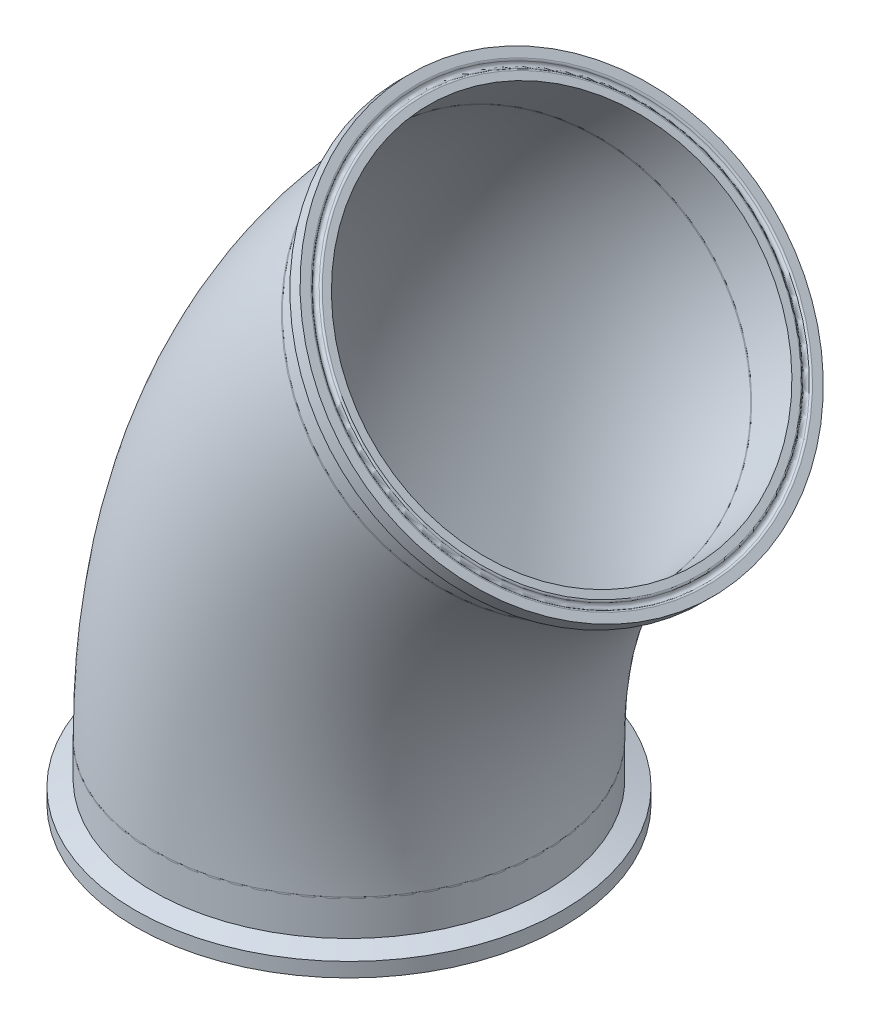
ISO-10303-21;
HEADER;
FILE_DESCRIPTION(('STEP AP214'),'2;1');
FILE_NAME('part.step','',(''),(''),'','','');
FILE_SCHEMA(('AUTOMOTIVE_DESIGN { 1 0 10303 214 1 1 1 1 }'));
ENDSEC;
DATA;
#1=APPLICATION_CONTEXT('core data for automotive mechanical design processes');
#2=APPLICATION_PROTOCOL_DEFINITION('international standard','automotive_design',2000,#1);
#3=PRODUCT_CONTEXT('',#1,'mechanical');
#4=PRODUCT('Part','Part','',(#3));
#5=PRODUCT_RELATED_PRODUCT_CATEGORY('part','',(#4));
#6=PRODUCT_DEFINITION_FORMATION('','',#4);
#7=PRODUCT_DEFINITION_CONTEXT('part definition',#1,'design');
#8=PRODUCT_DEFINITION('design','',#6,#7);
#9=PRODUCT_DEFINITION_SHAPE('','',#8);
#10=(LENGTH_UNIT() NAMED_UNIT(*) SI_UNIT(.MILLI.,.METRE.));
#11=(NAMED_UNIT(*) PLANE_ANGLE_UNIT() SI_UNIT($,.RADIAN.));
#12=(NAMED_UNIT(*) SI_UNIT($,.STERADIAN.) SOLID_ANGLE_UNIT());
#13=UNCERTAINTY_MEASURE_WITH_UNIT(LENGTH_MEASURE(1.E-05),#10,'distance_accuracy_value','');
#14=(GEOMETRIC_REPRESENTATION_CONTEXT(3) GLOBAL_UNCERTAINTY_ASSIGNED_CONTEXT((#13)) GLOBAL_UNIT_ASSIGNED_CONTEXT((#10,
#11,#12)) REPRESENTATION_CONTEXT('',''));
#15=CARTESIAN_POINT('',(0.,0.,0.));
#16=DIRECTION('',(0.,0.,1.));
#17=DIRECTION('',(1.,0.,0.));
#18=AXIS2_PLACEMENT_3D('',#15,#16,#17);
#19=CARTESIAN_POINT('',(158.379759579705,236.793848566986,205.413765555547));
#20=DIRECTION('',(0.707106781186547,0.707106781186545,0.));
#21=DIRECTION('',(0.688207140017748,-0.68820714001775,0.229655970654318));
#22=AXIS2_PLACEMENT_3D('',#19,#20,#21);
#23=TOROIDAL_SURFACE('',#22,79.9992084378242,0.787400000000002);
#24=CARTESIAN_POINT('',(158.936535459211,237.350624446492,205.413765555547));
#25=DIRECTION('',(0.707106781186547,0.707106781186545,0.));
#26=DIRECTION('',(0.688207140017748,-0.68820714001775,0.229655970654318));
#27=AXIS2_PLACEMENT_3D('',#24,#25,#26);
#28=CIRCLE('',#27,79.9992084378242);
#29=CARTESIAN_POINT('',(213.99256190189,182.294598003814,223.786061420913));
#30=VERTEX_POINT('',#29);
#31=EDGE_CURVE('P0_E48',#30,#30,#28,.T.);
#32=ORIENTED_EDGE('',*,*,#31,.T.);
#33=EDGE_LOOP('',(#32));
#34=FACE_BOUND('',#33,.T.);
#35=CARTESIAN_POINT('',(158.601042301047,237.015131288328,205.413765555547));
#36=DIRECTION('',(0.707106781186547,0.707106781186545,0.));
#37=DIRECTION('',(0.688207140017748,-0.68820714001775,0.229655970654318));
#38=AXIS2_PLACEMENT_3D('',#35,#36,#37);
#39=CIRCLE('',#38,79.2766666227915);
#40=CARTESIAN_POINT('',(213.159810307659,182.456363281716,223.620125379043));
#41=VERTEX_POINT('',#40);
#42=EDGE_CURVE('P0_E9',#41,#41,#39,.T.);
#43=ORIENTED_EDGE('',*,*,#42,.F.);
#44=EDGE_LOOP('',(#43));
#45=FACE_BOUND('',#44,.T.);
#46=ADVANCED_FACE('P0_F14',(#34,#45),#23,.T.);
#47=CARTESIAN_POINT('',(158.936535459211,237.350624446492,205.413765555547));
#48=DIRECTION('',(0.707106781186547,0.707106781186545,0.));
#49=DIRECTION('',(0.688207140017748,-0.68820714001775,0.229655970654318));
#50=AXIS2_PLACEMENT_3D('',#47,#48,#49);
#51=TOROIDAL_SURFACE('',#50,78.1812,1.1938);
#52=CARTESIAN_POINT('',(158.601042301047,237.015131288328,205.413765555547));
#53=DIRECTION('',(0.707106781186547,0.707106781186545,0.));
#54=DIRECTION('',(0.688207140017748,-0.68820714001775,0.229655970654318));
#55=AXIS2_PLACEMENT_3D('',#52,#53,#54);
#56=CIRCLE('',#55,77.0857333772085);
#57=CARTESIAN_POINT('',(211.651994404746,183.964179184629,223.11696447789));
#58=VERTEX_POINT('',#57);
#59=EDGE_CURVE('P0_E20',#58,#58,#56,.T.);
#60=ORIENTED_EDGE('',*,*,#59,.F.);
#61=EDGE_LOOP('',(#60));
#62=FACE_BOUND('',#61,.T.);
#63=ORIENTED_EDGE('',*,*,#42,.T.);
#64=EDGE_LOOP('',(#63));
#65=FACE_BOUND('',#64,.T.);
#66=ADVANCED_FACE('P0_F97',(#62,#65),#51,.F.);
#67=CARTESIAN_POINT('',(158.379759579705,236.793848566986,205.413765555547));
#68=DIRECTION('',(0.707106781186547,0.707106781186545,0.));
#69=DIRECTION('',(0.688207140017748,-0.68820714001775,0.229655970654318));
#70=AXIS2_PLACEMENT_3D('',#67,#68,#69);
#71=TOROIDAL_SURFACE('',#70,76.3631915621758,0.787399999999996);
#72=ORIENTED_EDGE('',*,*,#59,.T.);
#73=EDGE_LOOP('',(#72));
#74=FACE_BOUND('',#73,.T.);
#75=CARTESIAN_POINT('',(158.936535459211,237.350624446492,205.413765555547));
#76=DIRECTION('',(0.707106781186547,0.707106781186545,0.));
#77=DIRECTION('',(0.688207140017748,-0.68820714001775,0.229655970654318));
#78=AXIS2_PLACEMENT_3D('',#75,#76,#77);
#79=CIRCLE('',#78,76.3631915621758);
#80=CARTESIAN_POINT('',(211.490229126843,184.79693077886,222.95102843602));
#81=VERTEX_POINT('',#80);
#82=EDGE_CURVE('P0_E24',#81,#81,#79,.T.);
#83=ORIENTED_EDGE('',*,*,#82,.F.);
#84=EDGE_LOOP('',(#83));
#85=FACE_BOUND('',#84,.T.);
#86=ADVANCED_FACE('P0_F93',(#74,#85),#71,.T.);
#87=CARTESIAN_POINT('',(158.936535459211,237.350624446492,205.413765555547));
#88=DIRECTION('',(-0.707106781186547,-0.707106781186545,0.));
#89=DIRECTION('',(-0.688207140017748,0.68820714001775,-0.229655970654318));
#90=AXIS2_PLACEMENT_3D('',#87,#88,#89);
#91=PLANE('',#90);
#92=CARTESIAN_POINT('',(158.936535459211,237.350624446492,205.413765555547));
#93=DIRECTION('',(0.707106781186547,0.707106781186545,0.));
#94=DIRECTION('',(0.688207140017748,-0.68820714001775,0.229655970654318));
#95=AXIS2_PLACEMENT_3D('',#92,#93,#94);
#96=CIRCLE('',#95,73.4314);
#97=CARTESIAN_POINT('',(209.47254924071,186.814610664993,222.277724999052));
#98=VERTEX_POINT('',#97);
#99=EDGE_CURVE('P0_E28',#98,#98,#96,.T.);
#100=ORIENTED_EDGE('',*,*,#99,.F.);
#101=EDGE_LOOP('',(#100));
#102=FACE_BOUND('',#101,.T.);
#103=ORIENTED_EDGE('',*,*,#82,.T.);
#104=EDGE_LOOP('',(#103));
#105=FACE_BOUND('',#104,.T.);
#106=ADVANCED_FACE('P0_F86',(#102,#105),#91,.F.);
#107=CARTESIAN_POINT('',(158.936535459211,237.350624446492,205.413765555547));
#108=DIRECTION('',(0.707106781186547,0.707106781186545,0.));
#109=DIRECTION('',(0.688207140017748,-0.68820714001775,0.229655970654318));
#110=AXIS2_PLACEMENT_3D('',#107,#108,#109);
#111=CYLINDRICAL_SURFACE('',#110,73.4314);
#112=CARTESIAN_POINT('',(143.22108724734,221.635176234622,205.413765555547));
#113=DIRECTION('',(0.707106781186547,0.707106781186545,0.));
#114=DIRECTION('',(0.688207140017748,-0.68820714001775,0.229655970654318));
#115=AXIS2_PLACEMENT_3D('',#112,#113,#114);
#116=CIRCLE('',#115,73.4314);
#117=CARTESIAN_POINT('',(193.757101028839,171.099162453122,222.277724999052));
#118=VERTEX_POINT('',#117);
#119=EDGE_CURVE('P0_E33',#118,#118,#116,.T.);
#120=CARTESIAN_POINT('',(209.47254924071,186.814610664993,222.277724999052));
#121=CARTESIAN_POINT('',(209.30884665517,186.650908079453,222.277724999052));
#122=CARTESIAN_POINT('',(209.14514406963,186.487205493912,222.277724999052));
#123=CARTESIAN_POINT('',(208.817738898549,186.159800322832,222.277724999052));
#124=CARTESIAN_POINT('',(208.654036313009,185.996097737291,222.277724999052));
#125=CARTESIAN_POINT('',(208.326631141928,185.668692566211,222.277724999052));
#126=CARTESIAN_POINT('',(208.162928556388,185.50498998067,222.277724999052));
#127=CARTESIAN_POINT('',(207.835523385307,185.17758480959,222.277724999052));
#128=CARTESIAN_POINT('',(207.671820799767,185.013882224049,222.277724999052));
#129=CARTESIAN_POINT('',(207.344415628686,184.686477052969,222.277724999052));
#130=CARTESIAN_POINT('',(207.180713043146,184.522774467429,222.277724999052));
#131=CARTESIAN_POINT('',(206.853307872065,184.195369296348,222.277724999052));
#132=CARTESIAN_POINT('',(206.689605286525,184.031666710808,222.277724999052));
#133=CARTESIAN_POINT('',(206.362200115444,183.704261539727,222.277724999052));
#134=CARTESIAN_POINT('',(206.198497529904,183.540558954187,222.277724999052));
#135=CARTESIAN_POINT('',(205.871092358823,183.213153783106,222.277724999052));
#136=CARTESIAN_POINT('',(205.707389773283,183.049451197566,222.277724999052));
#137=CARTESIAN_POINT('',(205.379984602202,182.722046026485,222.277724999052));
#138=CARTESIAN_POINT('',(205.216282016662,182.558343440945,222.277724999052));
#139=CARTESIAN_POINT('',(204.888876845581,182.230938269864,222.277724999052));
#140=CARTESIAN_POINT('',(204.725174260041,182.067235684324,222.277724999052));
#141=CARTESIAN_POINT('',(204.39776908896,181.739830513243,222.277724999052));
#142=CARTESIAN_POINT('',(204.23406650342,181.576127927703,222.277724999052));
#143=CARTESIAN_POINT('',(203.906661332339,181.248722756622,222.277724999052));
#144=CARTESIAN_POINT('',(203.742958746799,181.085020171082,222.277724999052));
#145=CARTESIAN_POINT('',(203.415553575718,180.757615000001,222.277724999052));
#146=CARTESIAN_POINT('',(203.251850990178,180.593912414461,222.277724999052));
#147=CARTESIAN_POINT('',(202.924445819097,180.26650724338,222.277724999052));
#148=CARTESIAN_POINT('',(202.760743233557,180.10280465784,222.277724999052));
#149=CARTESIAN_POINT('',(202.433338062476,179.775399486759,222.277724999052));
#150=CARTESIAN_POINT('',(202.269635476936,179.611696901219,222.277724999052));
#151=CARTESIAN_POINT('',(201.942230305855,179.284291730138,222.277724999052));
#152=CARTESIAN_POINT('',(201.778527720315,179.120589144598,222.277724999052));
#153=CARTESIAN_POINT('',(201.451122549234,178.793183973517,222.277724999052));
#154=CARTESIAN_POINT('',(201.287419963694,178.629481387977,222.277724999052));
#155=CARTESIAN_POINT('',(200.960014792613,178.302076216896,222.277724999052));
#156=CARTESIAN_POINT('',(200.796312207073,178.138373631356,222.277724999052));
#157=CARTESIAN_POINT('',(200.468907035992,177.810968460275,222.277724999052));
#158=CARTESIAN_POINT('',(200.305204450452,177.647265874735,222.277724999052));
#159=CARTESIAN_POINT('',(199.977799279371,177.319860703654,222.277724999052));
#160=CARTESIAN_POINT('',(199.814096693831,177.156158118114,222.277724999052));
#161=CARTESIAN_POINT('',(199.486691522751,176.828752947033,222.277724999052));
#162=CARTESIAN_POINT('',(199.32298893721,176.665050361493,222.277724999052));
#163=CARTESIAN_POINT('',(198.99558376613,176.337645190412,222.277724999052));
#164=CARTESIAN_POINT('',(198.831881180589,176.173942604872,222.277724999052));
#165=CARTESIAN_POINT('',(198.504476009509,175.846537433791,222.277724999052));
#166=CARTESIAN_POINT('',(198.340773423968,175.682834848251,222.277724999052));
#167=CARTESIAN_POINT('',(198.013368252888,175.355429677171,222.277724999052));
#168=CARTESIAN_POINT('',(197.849665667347,175.19172709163,222.277724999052));
#169=CARTESIAN_POINT('',(197.522260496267,174.86432192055,222.277724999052));
#170=CARTESIAN_POINT('',(197.358557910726,174.700619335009,222.277724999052));
#171=CARTESIAN_POINT('',(197.031152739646,174.373214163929,222.277724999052));
#172=CARTESIAN_POINT('',(196.867450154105,174.209511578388,222.277724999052));
#173=CARTESIAN_POINT('',(196.540044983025,173.882106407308,222.277724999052));
#174=CARTESIAN_POINT('',(196.376342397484,173.718403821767,222.277724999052));
#175=CARTESIAN_POINT('',(196.048937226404,173.390998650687,222.277724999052));
#176=CARTESIAN_POINT('',(195.885234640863,173.227296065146,222.277724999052));
#177=CARTESIAN_POINT('',(195.557829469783,172.899890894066,222.277724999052));
#178=CARTESIAN_POINT('',(195.394126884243,172.736188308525,222.277724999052));
#179=CARTESIAN_POINT('',(195.066721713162,172.408783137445,222.277724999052));
#180=CARTESIAN_POINT('',(194.903019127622,172.245080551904,222.277724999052));
#181=CARTESIAN_POINT('',(194.575613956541,171.917675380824,222.277724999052));
#182=CARTESIAN_POINT('',(194.411911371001,171.753972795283,222.277724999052));
#183=CARTESIAN_POINT('',(194.08450619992,171.426567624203,222.277724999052));
#184=CARTESIAN_POINT('',(193.92080361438,171.262865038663,222.277724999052));
#185=CARTESIAN_POINT('',(193.757101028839,171.099162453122,222.277724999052));
#186=B_SPLINE_CURVE_WITH_KNOTS('',3,(#120,#121,#122,#123,#124,#125,#126,#127,#128,#129,#130,
#131,#132,#133,#134,#135,#136,#137,#138,#139,#140,#141,#142,#143,#144,#145,#146,#147,#148,#149,
#150,#151,#152,#153,#154,#155,#156,#157,#158,#159,#160,#161,#162,#163,#164,#165,#166,#167,#168,
#169,#170,#171,#172,#173,#174,#175,#176,#177,#178,#179,#180,#181,#182,#183,#184,#185),
.UNSPECIFIED.,.F.,.F.,(4,2,2,2,2,2,2,2,2,2,2,2,2,2,2,2,2,2,2,2,2,2,2,2,2,2,2,2,2,2,2,2,4),(0.,
0.694531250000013,1.38906249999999,2.08359375,2.77812499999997,3.47265624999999,
4.16718749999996,4.86171874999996,5.55624999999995,6.25078124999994,6.94531249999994,
7.63984374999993,8.33437499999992,9.02890624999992,9.72343749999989,10.4179687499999,
11.1124999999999,11.8070312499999,12.5015624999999,13.1960937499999,13.8906249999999,
14.5851562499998,15.2796874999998,15.9742187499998,16.6687499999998,17.3632812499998,
18.0578124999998,18.7523437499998,19.4468749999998,20.1414062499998,20.8359374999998,
21.5304687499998,22.2249999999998),.UNSPECIFIED.);
#187=EDGE_CURVE('P0_BSEAM81',#98,#118,#186,.T.);
#188=ORIENTED_EDGE('',*,*,#99,.T.);
#189=ORIENTED_EDGE('',*,*,#119,.F.);
#190=ORIENTED_EDGE('',*,*,#187,.T.);
#191=ORIENTED_EDGE('',*,*,#187,.F.);
#192=EDGE_LOOP('',(#188,#190,#189,#191));
#193=FACE_BOUND('',#192,.T.);
#194=ADVANCED_FACE('P0_F81',(#193),#111,.F.);
#195=CARTESIAN_POINT('',(143.22108724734,221.635176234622,205.413765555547));
#196=DIRECTION('',(0.707106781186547,0.707106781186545,0.));
#197=DIRECTION('',(0.688207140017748,-0.68820714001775,0.229655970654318));
#198=AXIS2_PLACEMENT_3D('',#195,#196,#197);
#199=PLANE('',#198);
#200=CARTESIAN_POINT('',(143.22108724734,221.635176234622,205.413765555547));
#201=DIRECTION('',(0.707106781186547,0.707106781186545,0.));
#202=DIRECTION('',(0.688207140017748,-0.68820714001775,0.229655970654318));
#203=AXIS2_PLACEMENT_3D('',#200,#201,#202);
#204=CIRCLE('',#203,76.2);
#205=CARTESIAN_POINT('',(195.662471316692,169.193792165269,222.913550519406));
#206=VERTEX_POINT('',#205);
#207=EDGE_CURVE('P0_E36',#206,#206,#204,.T.);
#208=ORIENTED_EDGE('',*,*,#207,.F.);
#209=EDGE_LOOP('',(#208));
#210=FACE_BOUND('',#209,.T.);
#211=ORIENTED_EDGE('',*,*,#119,.T.);
#212=EDGE_LOOP('',(#211));
#213=FACE_BOUND('',#212,.T.);
#214=ADVANCED_FACE('P0_F75',(#210,#213),#199,.F.);
#215=CARTESIAN_POINT('',(158.936535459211,237.350624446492,205.413765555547));
#216=DIRECTION('',(0.707106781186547,0.707106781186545,0.));
#217=DIRECTION('',(0.688207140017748,-0.68820714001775,0.229655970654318));
#218=AXIS2_PLACEMENT_3D('',#215,#216,#217);
#219=CYLINDRICAL_SURFACE('',#218,76.2);
#220=CARTESIAN_POINT('',(153.122151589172,231.536240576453,205.413765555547));
#221=DIRECTION('',(0.707106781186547,0.707106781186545,0.));
#222=DIRECTION('',(0.688207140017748,-0.68820714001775,0.229655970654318));
#223=AXIS2_PLACEMENT_3D('',#220,#221,#222);
#224=CIRCLE('',#223,76.2);
#225=CARTESIAN_POINT('',(205.563535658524,179.094856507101,222.913550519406));
#226=VERTEX_POINT('',#225);
#227=EDGE_CURVE('P0_E39',#226,#226,#224,.T.);
#228=CARTESIAN_POINT('',(205.563535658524,179.094856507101,222.913550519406));
#229=CARTESIAN_POINT('',(205.46039957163,178.991720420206,222.913550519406));
#230=CARTESIAN_POINT('',(205.357263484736,178.888584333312,222.913550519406));
#231=CARTESIAN_POINT('',(205.150991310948,178.682312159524,222.913550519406));
#232=CARTESIAN_POINT('',(205.047855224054,178.57917607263,222.913550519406));
#233=CARTESIAN_POINT('',(204.841583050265,178.372903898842,222.913550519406));
#234=CARTESIAN_POINT('',(204.738446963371,178.269767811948,222.913550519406));
#235=CARTESIAN_POINT('',(204.532174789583,178.06349563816,222.913550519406));
#236=CARTESIAN_POINT('',(204.429038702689,177.960359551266,222.913550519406));
#237=CARTESIAN_POINT('',(204.222766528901,177.754087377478,222.913550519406));
#238=CARTESIAN_POINT('',(204.119630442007,177.650951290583,222.913550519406));
#239=CARTESIAN_POINT('',(203.913358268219,177.444679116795,222.913550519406));
#240=CARTESIAN_POINT('',(203.810222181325,177.341543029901,222.913550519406));
#241=CARTESIAN_POINT('',(203.603950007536,177.135270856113,222.913550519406));
#242=CARTESIAN_POINT('',(203.500813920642,177.032134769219,222.913550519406));
#243=CARTESIAN_POINT('',(203.294541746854,176.825862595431,222.913550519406));
#244=CARTESIAN_POINT('',(203.19140565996,176.722726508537,222.913550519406));
#245=CARTESIAN_POINT('',(202.985133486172,176.516454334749,222.913550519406));
#246=CARTESIAN_POINT('',(202.881997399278,176.413318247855,222.913550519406));
#247=CARTESIAN_POINT('',(202.67572522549,176.207046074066,222.913550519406));
#248=CARTESIAN_POINT('',(202.572589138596,176.103909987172,222.913550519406));
#249=CARTESIAN_POINT('',(202.366316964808,175.897637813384,222.913550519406));
#250=CARTESIAN_POINT('',(202.263180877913,175.79450172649,222.913550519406));
#251=CARTESIAN_POINT('',(202.056908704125,175.588229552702,222.913550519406));
#252=CARTESIAN_POINT('',(201.953772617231,175.485093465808,222.913550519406));
#253=CARTESIAN_POINT('',(201.747500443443,175.27882129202,222.913550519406));
#254=CARTESIAN_POINT('',(201.644364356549,175.175685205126,222.913550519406));
#255=CARTESIAN_POINT('',(201.438092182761,174.969413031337,222.913550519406));
#256=CARTESIAN_POINT('',(201.334956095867,174.866276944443,222.913550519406));
#257=CARTESIAN_POINT('',(201.128683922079,174.660004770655,222.913550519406));
#258=CARTESIAN_POINT('',(201.025547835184,174.556868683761,222.913550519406));
#259=CARTESIAN_POINT('',(200.819275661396,174.350596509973,222.913550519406));
#260=CARTESIAN_POINT('',(200.716139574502,174.247460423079,222.913550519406));
#261=CARTESIAN_POINT('',(200.509867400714,174.041188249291,222.913550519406));
#262=CARTESIAN_POINT('',(200.40673131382,173.938052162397,222.913550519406));
#263=CARTESIAN_POINT('',(200.200459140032,173.731779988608,222.913550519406));
#264=CARTESIAN_POINT('',(200.097323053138,173.628643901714,222.913550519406));
#265=CARTESIAN_POINT('',(199.89105087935,173.422371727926,222.913550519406));
#266=CARTESIAN_POINT('',(199.787914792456,173.319235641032,222.913550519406));
#267=CARTESIAN_POINT('',(199.581642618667,173.112963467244,222.913550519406));
#268=CARTESIAN_POINT('',(199.478506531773,173.00982738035,222.913550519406));
#269=CARTESIAN_POINT('',(199.272234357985,172.803555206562,222.913550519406));
#270=CARTESIAN_POINT('',(199.169098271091,172.700419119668,222.913550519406));
#271=CARTESIAN_POINT('',(198.962826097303,172.49414694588,222.913550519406));
#272=CARTESIAN_POINT('',(198.859690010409,172.391010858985,222.913550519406));
#273=CARTESIAN_POINT('',(198.653417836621,172.184738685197,222.913550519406));
#274=CARTESIAN_POINT('',(198.550281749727,172.081602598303,222.913550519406));
#275=CARTESIAN_POINT('',(198.344009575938,171.875330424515,222.913550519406));
#276=CARTESIAN_POINT('',(198.240873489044,171.772194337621,222.913550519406));
#277=CARTESIAN_POINT('',(198.034601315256,171.565922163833,222.913550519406));
#278=CARTESIAN_POINT('',(197.931465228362,171.462786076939,222.913550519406));
#279=CARTESIAN_POINT('',(197.725193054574,171.256513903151,222.913550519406));
#280=CARTESIAN_POINT('',(197.62205696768,171.153377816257,222.913550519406));
#281=CARTESIAN_POINT('',(197.415784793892,170.947105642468,222.913550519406));
#282=CARTESIAN_POINT('',(197.312648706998,170.843969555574,222.913550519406));
#283=CARTESIAN_POINT('',(197.106376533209,170.637697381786,222.913550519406));
#284=CARTESIAN_POINT('',(197.003240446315,170.534561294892,222.913550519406));
#285=CARTESIAN_POINT('',(196.796968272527,170.328289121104,222.913550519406));
#286=CARTESIAN_POINT('',(196.693832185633,170.22515303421,222.913550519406));
#287=CARTESIAN_POINT('',(196.487560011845,170.018880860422,222.913550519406));
#288=CARTESIAN_POINT('',(196.384423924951,169.915744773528,222.913550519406));
#289=CARTESIAN_POINT('',(196.178151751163,169.709472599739,222.913550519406));
#290=CARTESIAN_POINT('',(196.075015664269,169.606336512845,222.913550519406));
#291=CARTESIAN_POINT('',(195.868743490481,169.400064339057,222.913550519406));
#292=CARTESIAN_POINT('',(195.765607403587,169.296928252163,222.913550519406));
#293=CARTESIAN_POINT('',(195.662471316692,169.193792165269,222.913550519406));
#294=B_SPLINE_CURVE_WITH_KNOTS('',3,(#228,#229,#230,#231,#232,#233,#234,#235,#236,#237,#238,
#239,#240,#241,#242,#243,#244,#245,#246,#247,#248,#249,#250,#251,#252,#253,#254,#255,#256,#257,
#258,#259,#260,#261,#262,#263,#264,#265,#266,#267,#268,#269,#270,#271,#272,#273,#274,#275,#276,
#277,#278,#279,#280,#281,#282,#283,#284,#285,#286,#287,#288,#289,#290,#291,#292,#293),
.UNSPECIFIED.,.F.,.F.,(4,2,2,2,2,2,2,2,2,2,2,2,2,2,2,2,2,2,2,2,2,2,2,2,2,2,2,2,2,2,2,2,4),(0.,
0.43756935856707,0.875138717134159,1.31270807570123,1.75027743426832,2.18784679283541,
2.6254161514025,3.06298550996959,3.50055486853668,3.93812422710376,4.37569358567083,
4.8132629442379,5.25083230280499,5.68840166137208,6.12597101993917,6.56354037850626,
7.00110973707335,7.43867909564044,7.87624845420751,8.3138178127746,8.75138717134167,
9.18895652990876,9.62652588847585,10.0640952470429,10.50166460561,10.9392339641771,
11.3768033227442,11.8143726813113,12.2519420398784,12.6895113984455,13.1270807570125,
13.5646501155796,14.0022194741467),.UNSPECIFIED.);
#295=EDGE_CURVE('P0_BSEAM69',#226,#206,#294,.T.);
#296=ORIENTED_EDGE('',*,*,#227,.F.);
#297=ORIENTED_EDGE('',*,*,#207,.T.);
#298=ORIENTED_EDGE('',*,*,#295,.T.);
#299=ORIENTED_EDGE('',*,*,#295,.F.);
#300=EDGE_LOOP('',(#296,#298,#297,#299));
#301=FACE_BOUND('',#300,.T.);
#302=ADVANCED_FACE('P0_F69',(#301),#219,.T.);
#303=CARTESIAN_POINT('',(153.122151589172,231.536240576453,205.413765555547));
#304=DIRECTION('',(0.707106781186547,0.707106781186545,0.));
#305=DIRECTION('',(0.688207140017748,-0.68820714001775,0.229655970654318));
#306=AXIS2_PLACEMENT_3D('',#303,#304,#305);
#307=CONICAL_SURFACE('',#306,76.2,1.22173047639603);
#308=CARTESIAN_POINT('',(154.985222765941,233.399311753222,205.413765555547));
#309=DIRECTION('',(0.707106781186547,0.707106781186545,0.));
#310=DIRECTION('',(0.688207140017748,-0.68820714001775,0.229655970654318));
#311=AXIS2_PLACEMENT_3D('',#308,#309,#310);
#312=CIRCLE('',#311,83.439);
#313=CARTESIAN_POINT('',(212.408538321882,175.975996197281,224.576030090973));
#314=VERTEX_POINT('',#313);
#315=EDGE_CURVE('P0_E42',#314,#314,#312,.T.);
#316=CARTESIAN_POINT('',(212.408538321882,175.975996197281,224.576030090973));
#317=CARTESIAN_POINT('',(212.337236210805,176.008484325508,224.558712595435));
#318=CARTESIAN_POINT('',(212.265934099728,176.040972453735,224.541395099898));
#319=CARTESIAN_POINT('',(212.123329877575,176.10594871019,224.506760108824));
#320=CARTESIAN_POINT('',(212.052027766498,176.138436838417,224.489442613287));
#321=CARTESIAN_POINT('',(211.909423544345,176.203413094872,224.454807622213));
#322=CARTESIAN_POINT('',(211.838121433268,176.235901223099,224.437490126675));
#323=CARTESIAN_POINT('',(211.695517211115,176.300877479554,224.402855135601));
#324=CARTESIAN_POINT('',(211.624215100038,176.333365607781,224.385537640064));
#325=CARTESIAN_POINT('',(211.481610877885,176.398341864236,224.35090264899));
#326=CARTESIAN_POINT('',(211.410308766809,176.430829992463,224.333585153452));
#327=CARTESIAN_POINT('',(211.267704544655,176.495806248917,224.298950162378));
#328=CARTESIAN_POINT('',(211.196402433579,176.528294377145,224.281632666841));
#329=CARTESIAN_POINT('',(211.053798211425,176.593270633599,224.246997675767));
#330=CARTESIAN_POINT('',(210.982496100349,176.625758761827,224.22968018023));
#331=CARTESIAN_POINT('',(210.839891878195,176.690735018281,224.195045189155));
#332=CARTESIAN_POINT('',(210.768589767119,176.723223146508,224.177727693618));
#333=CARTESIAN_POINT('',(210.625985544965,176.788199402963,224.143092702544));
#334=CARTESIAN_POINT('',(210.554683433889,176.82068753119,224.125775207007));
#335=CARTESIAN_POINT('',(210.412079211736,176.885663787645,224.091140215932));
#336=CARTESIAN_POINT('',(210.340777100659,176.918151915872,224.073822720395));
#337=CARTESIAN_POINT('',(210.198172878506,176.983128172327,224.039187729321));
#338=CARTESIAN_POINT('',(210.126870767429,177.015616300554,224.021870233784));
#339=CARTESIAN_POINT('',(209.984266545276,177.080592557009,223.987235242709));
#340=CARTESIAN_POINT('',(209.912964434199,177.113080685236,223.969917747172));
#341=CARTESIAN_POINT('',(209.770360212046,177.17805694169,223.935282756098));
#342=CARTESIAN_POINT('',(209.699058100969,177.210545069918,223.917965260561));
#343=CARTESIAN_POINT('',(209.556453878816,177.275521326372,223.883330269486));
#344=CARTESIAN_POINT('',(209.485151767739,177.3080094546,223.866012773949));
#345=CARTESIAN_POINT('',(209.342547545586,177.372985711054,223.831377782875));
#346=CARTESIAN_POINT('',(209.271245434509,177.405473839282,223.814060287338));
#347=CARTESIAN_POINT('',(209.128641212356,177.470450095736,223.779425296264));
#348=CARTESIAN_POINT('',(209.057339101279,177.502938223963,223.762107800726));
#349=CARTESIAN_POINT('',(208.914734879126,177.567914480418,223.727472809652));
#350=CARTESIAN_POINT('',(208.843432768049,177.600402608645,223.710155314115));
#351=CARTESIAN_POINT('',(208.700828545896,177.6653788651,223.675520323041));
#352=CARTESIAN_POINT('',(208.629526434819,177.697866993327,223.658202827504));
#353=CARTESIAN_POINT('',(208.486922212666,177.762843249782,223.623567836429));
#354=CARTESIAN_POINT('',(208.41562010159,177.795331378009,223.606250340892));
#355=CARTESIAN_POINT('',(208.273015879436,177.860307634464,223.571615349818));
#356=CARTESIAN_POINT('',(208.20171376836,177.892795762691,223.554297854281));
#357=CARTESIAN_POINT('',(208.059109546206,177.957772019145,223.519662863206));
#358=CARTESIAN_POINT('',(207.98780743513,177.990260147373,223.502345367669));
#359=CARTESIAN_POINT('',(207.845203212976,178.055236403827,223.467710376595));
#360=CARTESIAN_POINT('',(207.7739011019,178.087724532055,223.450392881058));
#361=CARTESIAN_POINT('',(207.631296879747,178.152700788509,223.415757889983));
#362=CARTESIAN_POINT('',(207.55999476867,178.185188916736,223.398440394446));
#363=CARTESIAN_POINT('',(207.417390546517,178.250165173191,223.363805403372));
#364=CARTESIAN_POINT('',(207.34608843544,178.282653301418,223.346487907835));
#365=CARTESIAN_POINT('',(207.203484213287,178.347629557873,223.31185291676));
#366=CARTESIAN_POINT('',(207.13218210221,178.3801176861,223.294535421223));
#367=CARTESIAN_POINT('',(206.989577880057,178.445093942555,223.259900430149));
#368=CARTESIAN_POINT('',(206.91827576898,178.477582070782,223.242582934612));
#369=CARTESIAN_POINT('',(206.775671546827,178.542558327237,223.207947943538));
#370=CARTESIAN_POINT('',(206.70436943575,178.575046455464,223.190630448));
#371=CARTESIAN_POINT('',(206.561765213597,178.640022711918,223.155995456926));
#372=CARTESIAN_POINT('',(206.49046310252,178.672510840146,223.138677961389));
#373=CARTESIAN_POINT('',(206.347858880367,178.7374870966,223.104042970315));
#374=CARTESIAN_POINT('',(206.27655676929,178.769975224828,223.086725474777));
#375=CARTESIAN_POINT('',(206.133952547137,178.834951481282,223.052090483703));
#376=CARTESIAN_POINT('',(206.06265043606,178.867439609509,223.034772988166));
#377=CARTESIAN_POINT('',(205.920046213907,178.932415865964,223.000137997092));
#378=CARTESIAN_POINT('',(205.848744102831,178.964903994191,222.982820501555));
#379=CARTESIAN_POINT('',(205.706139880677,179.029880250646,222.94818551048));
#380=CARTESIAN_POINT('',(205.634837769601,179.062368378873,222.930868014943));
#381=CARTESIAN_POINT('',(205.563535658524,179.0948565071,222.913550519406));
#382=B_SPLINE_CURVE_WITH_KNOTS('',3,(#316,#317,#318,#319,#320,#321,#322,#323,#324,#325,#326,
#327,#328,#329,#330,#331,#332,#333,#334,#335,#336,#337,#338,#339,#340,#341,#342,#343,#344,#345,
#346,#347,#348,#349,#350,#351,#352,#353,#354,#355,#356,#357,#358,#359,#360,#361,#362,#363,#364,
#365,#366,#367,#368,#369,#370,#371,#372,#373,#374,#375,#376,#377,#378,#379,#380,#381),
.UNSPECIFIED.,.F.,.F.,(4,2,2,2,2,2,2,2,2,2,2,2,2,2,2,2,2,2,2,2,2,2,2,2,2,2,2,2,2,2,2,2,4),(0.,
0.24073696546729,0.481473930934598,0.722210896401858,0.962947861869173,1.20368482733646,
1.44442179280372,1.68515875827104,1.92589572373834,2.1666326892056,2.4073696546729,
2.64810662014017,2.88884358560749,3.12958055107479,3.37031751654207,3.61105448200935,
3.85179144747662,4.09252841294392,4.33326537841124,4.57400234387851,4.81473930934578,
5.05547627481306,5.29621324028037,5.53695020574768,5.77768717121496,6.01842413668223,
6.25916110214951,6.49989806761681,6.74063503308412,6.98137199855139,7.22210896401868,
7.46284592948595,7.70358289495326),.UNSPECIFIED.);
#383=EDGE_CURVE('P0_BSEAM63',#314,#226,#382,.T.);
#384=ORIENTED_EDGE('',*,*,#315,.F.);
#385=ORIENTED_EDGE('',*,*,#227,.T.);
#386=ORIENTED_EDGE('',*,*,#383,.T.);
#387=ORIENTED_EDGE('',*,*,#383,.F.);
#388=EDGE_LOOP('',(#384,#386,#385,#387));
#389=FACE_BOUND('',#388,.T.);
#390=ADVANCED_FACE('P0_F63',(#389),#307,.T.);
#391=CARTESIAN_POINT('',(158.936535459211,237.350624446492,205.413765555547));
#392=DIRECTION('',(0.707106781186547,0.707106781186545,0.));
#393=DIRECTION('',(0.688207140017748,-0.68820714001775,0.229655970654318));
#394=AXIS2_PLACEMENT_3D('',#391,#392,#393);
#395=CYLINDRICAL_SURFACE('',#394,83.439);
#396=CARTESIAN_POINT('',(158.936535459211,237.350624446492,205.413765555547));
#397=DIRECTION('',(0.707106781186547,0.707106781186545,0.));
#398=DIRECTION('',(0.688207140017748,-0.68820714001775,0.229655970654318));
#399=AXIS2_PLACEMENT_3D('',#396,#397,#398);
#400=CIRCLE('',#399,83.439);
#401=CARTESIAN_POINT('',(216.359851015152,179.927308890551,224.576030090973));
#402=VERTEX_POINT('',#401);
#403=EDGE_CURVE('P0_E45',#402,#402,#400,.T.);
#404=CARTESIAN_POINT('',(216.359851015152,179.927308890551,224.576030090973));
#405=CARTESIAN_POINT('',(216.31869150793,179.88614938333,224.576030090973));
#406=CARTESIAN_POINT('',(216.277532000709,179.844989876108,224.576030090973));
#407=CARTESIAN_POINT('',(216.195212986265,179.762670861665,224.576030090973));
#408=CARTESIAN_POINT('',(216.154053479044,179.721511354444,224.576030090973));
#409=CARTESIAN_POINT('',(216.071734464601,179.63919234,224.576030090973));
#410=CARTESIAN_POINT('',(216.030574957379,179.598032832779,224.576030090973));
#411=CARTESIAN_POINT('',(215.948255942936,179.515713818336,224.576030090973));
#412=CARTESIAN_POINT('',(215.907096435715,179.474554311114,224.576030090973));
#413=CARTESIAN_POINT('',(215.824777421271,179.392235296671,224.576030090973));
#414=CARTESIAN_POINT('',(215.78361791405,179.351075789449,224.576030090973));
#415=CARTESIAN_POINT('',(215.701298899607,179.268756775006,224.576030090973));
#416=CARTESIAN_POINT('',(215.660139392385,179.227597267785,224.576030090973));
#417=CARTESIAN_POINT('',(215.577820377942,179.145278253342,224.576030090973));
#418=CARTESIAN_POINT('',(215.53666087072,179.10411874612,224.576030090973));
#419=CARTESIAN_POINT('',(215.454341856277,179.021799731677,224.576030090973));
#420=CARTESIAN_POINT('',(215.413182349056,178.980640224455,224.576030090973));
#421=CARTESIAN_POINT('',(215.330863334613,178.898321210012,224.576030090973));
#422=CARTESIAN_POINT('',(215.289703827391,178.857161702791,224.576030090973));
#423=CARTESIAN_POINT('',(215.207384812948,178.774842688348,224.576030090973));
#424=CARTESIAN_POINT('',(215.166225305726,178.733683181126,224.576030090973));
#425=CARTESIAN_POINT('',(215.083906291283,178.651364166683,224.576030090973));
#426=CARTESIAN_POINT('',(215.042746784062,178.610204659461,224.576030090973));
#427=CARTESIAN_POINT('',(214.960427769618,178.527885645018,224.576030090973));
#428=CARTESIAN_POINT('',(214.919268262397,178.486726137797,224.576030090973));
#429=CARTESIAN_POINT('',(214.836949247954,178.404407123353,224.576030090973));
#430=CARTESIAN_POINT('',(214.795789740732,178.363247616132,224.576030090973));
#431=CARTESIAN_POINT('',(214.713470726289,178.280928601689,224.576030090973));
#432=CARTESIAN_POINT('',(214.672311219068,178.239769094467,224.576030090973));
#433=CARTESIAN_POINT('',(214.589992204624,178.157450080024,224.576030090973));
#434=CARTESIAN_POINT('',(214.548832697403,178.116290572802,224.576030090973));
#435=CARTESIAN_POINT('',(214.46651368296,178.033971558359,224.576030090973));
#436=CARTESIAN_POINT('',(214.425354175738,177.992812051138,224.576030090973));
#437=CARTESIAN_POINT('',(214.343035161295,177.910493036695,224.576030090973));
#438=CARTESIAN_POINT('',(214.301875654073,177.869333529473,224.576030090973));
#439=CARTESIAN_POINT('',(214.21955663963,177.78701451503,224.576030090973));
#440=CARTESIAN_POINT('',(214.178397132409,177.745855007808,224.576030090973));
#441=CARTESIAN_POINT('',(214.096078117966,177.663535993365,224.576030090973));
#442=CARTESIAN_POINT('',(214.054918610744,177.622376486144,224.576030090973));
#443=CARTESIAN_POINT('',(213.972599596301,177.540057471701,224.576030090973));
#444=CARTESIAN_POINT('',(213.931440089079,177.498897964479,224.576030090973));
#445=CARTESIAN_POINT('',(213.849121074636,177.416578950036,224.576030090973));
#446=CARTESIAN_POINT('',(213.807961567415,177.375419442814,224.576030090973));
#447=CARTESIAN_POINT('',(213.725642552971,177.293100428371,224.576030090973));
#448=CARTESIAN_POINT('',(213.68448304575,177.25194092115,224.576030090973));
#449=CARTESIAN_POINT('',(213.602164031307,177.169621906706,224.576030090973));
#450=CARTESIAN_POINT('',(213.561004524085,177.128462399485,224.576030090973));
#451=CARTESIAN_POINT('',(213.478685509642,177.046143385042,224.576030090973));
#452=CARTESIAN_POINT('',(213.437526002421,177.00498387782,224.576030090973));
#453=CARTESIAN_POINT('',(213.355206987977,176.922664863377,224.576030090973));
#454=CARTESIAN_POINT('',(213.314047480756,176.881505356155,224.576030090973));
#455=CARTESIAN_POINT('',(213.231728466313,176.799186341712,224.576030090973));
#456=CARTESIAN_POINT('',(213.190568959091,176.758026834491,224.576030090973));
#457=CARTESIAN_POINT('',(213.108249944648,176.675707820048,224.576030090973));
#458=CARTESIAN_POINT('',(213.067090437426,176.634548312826,224.576030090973));
#459=CARTESIAN_POINT('',(212.984771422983,176.552229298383,224.576030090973));
#460=CARTESIAN_POINT('',(212.943611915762,176.511069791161,224.576030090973));
#461=CARTESIAN_POINT('',(212.861292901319,176.428750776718,224.576030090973));
#462=CARTESIAN_POINT('',(212.820133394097,176.387591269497,224.576030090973));
#463=CARTESIAN_POINT('',(212.737814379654,176.305272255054,224.576030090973));
#464=CARTESIAN_POINT('',(212.696654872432,176.264112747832,224.576030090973));
#465=CARTESIAN_POINT('',(212.614335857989,176.181793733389,224.576030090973));
#466=CARTESIAN_POINT('',(212.573176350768,176.140634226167,224.576030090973));
#467=CARTESIAN_POINT('',(212.490857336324,176.058315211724,224.576030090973));
#468=CARTESIAN_POINT('',(212.449697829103,176.017155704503,224.576030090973));
#469=CARTESIAN_POINT('',(212.408538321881,175.975996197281,224.576030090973));
#470=B_SPLINE_CURVE_WITH_KNOTS('',3,(#404,#405,#406,#407,#408,#409,#410,#411,#412,#413,#414,
#415,#416,#417,#418,#419,#420,#421,#422,#423,#424,#425,#426,#427,#428,#429,#430,#431,#432,#433,
#434,#435,#436,#437,#438,#439,#440,#441,#442,#443,#444,#445,#446,#447,#448,#449,#450,#451,#452,
#453,#454,#455,#456,#457,#458,#459,#460,#461,#462,#463,#464,#465,#466,#467,#468,#469),
.UNSPECIFIED.,.F.,.F.,(4,2,2,2,2,2,2,2,2,2,2,2,2,2,2,2,2,2,2,2,2,2,2,2,2,2,2,2,2,2,2,2,4),(0.,
0.174625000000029,0.349250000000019,0.52387500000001,0.6985,0.873125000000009,1.04775000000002,
1.22237500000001,1.397,1.57162499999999,1.74625,1.92087500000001,2.0955,2.27012499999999,
2.44474999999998,2.61937499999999,2.79399999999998,2.96862499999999,3.14324999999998,
3.31787499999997,3.49249999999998,3.66712499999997,3.84174999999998,4.01637499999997,
4.19099999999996,4.36562499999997,4.54024999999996,4.71487499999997,4.88949999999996,
5.06412499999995,5.23874999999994,5.41337499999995,5.58799999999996),.UNSPECIFIED.);
#471=EDGE_CURVE('P0_BSEAM57',#402,#314,#470,.T.);
#472=ORIENTED_EDGE('',*,*,#403,.F.);
#473=ORIENTED_EDGE('',*,*,#315,.T.);
#474=ORIENTED_EDGE('',*,*,#471,.T.);
#475=ORIENTED_EDGE('',*,*,#471,.F.);
#476=EDGE_LOOP('',(#472,#474,#473,#475));
#477=FACE_BOUND('',#476,.T.);
#478=ADVANCED_FACE('P0_F57',(#477),#395,.T.);
#479=CARTESIAN_POINT('',(158.936535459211,237.350624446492,205.413765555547));
#480=DIRECTION('',(-0.707106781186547,-0.707106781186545,0.));
#481=DIRECTION('',(-0.688207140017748,0.68820714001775,-0.229655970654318));
#482=AXIS2_PLACEMENT_3D('',#479,#480,#481);
#483=PLANE('',#482);
#484=ORIENTED_EDGE('',*,*,#31,.F.);
#485=EDGE_LOOP('',(#484));
#486=FACE_BOUND('',#485,.T.);
#487=ORIENTED_EDGE('',*,*,#403,.T.);
#488=EDGE_LOOP('',(#487));
#489=FACE_BOUND('',#488,.T.);
#490=ADVANCED_FACE('P0_F54',(#486,#489),#483,.F.);
#491=CLOSED_SHELL('',(#46,#66,#86,#106,#194,#214,#302,#390,#478,#490));
#492=MANIFOLD_SOLID_BREP('P0_B1',#491);
#493=CARTESIAN_POINT('',(75.8705661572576,38.1578347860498,205.413765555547));
#494=DIRECTION('',(0.,-0.999999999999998,0.));
#495=DIRECTION('',(0.,0.,-0.999999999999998));
#496=AXIS2_PLACEMENT_3D('',#493,#494,#495);
#497=TOROIDAL_SURFACE('',#496,79.9992084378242,0.787400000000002);
#498=CARTESIAN_POINT('',(75.8705661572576,37.3704347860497,205.413765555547));
#499=DIRECTION('',(0.,-0.999999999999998,0.));
#500=DIRECTION('',(0.,0.,-0.999999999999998));
#501=AXIS2_PLACEMENT_3D('',#498,#499,#500);
#502=CIRCLE('',#501,79.9992084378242);
#503=CARTESIAN_POINT('',(75.8705661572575,37.3704347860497,125.414557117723));
#504=VERTEX_POINT('',#503);
#505=EDGE_CURVE('P1_E49',#504,#504,#502,.T.);
#506=ORIENTED_EDGE('',*,*,#505,.T.);
#507=EDGE_LOOP('',(#506));
#508=FACE_BOUND('',#507,.T.);
#509=CARTESIAN_POINT('',(75.8705661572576,37.8448937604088,205.413765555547));
#510=DIRECTION('',(0.,-0.999999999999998,0.));
#511=DIRECTION('',(0.,0.,-0.999999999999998));
#512=AXIS2_PLACEMENT_3D('',#509,#510,#511);
#513=CIRCLE('',#512,79.2766666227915);
#514=CARTESIAN_POINT('',(75.8705661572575,37.8448937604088,126.137098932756));
#515=VERTEX_POINT('',#514);
#516=EDGE_CURVE('P1_E10',#515,#515,#513,.T.);
#517=ORIENTED_EDGE('',*,*,#516,.F.);
#518=EDGE_LOOP('',(#517));
#519=FACE_BOUND('',#518,.T.);
#520=ADVANCED_FACE('P1_F15',(#508,#519),#497,.T.);
#521=CARTESIAN_POINT('',(75.8705661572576,37.3704347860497,205.413765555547));
#522=DIRECTION('',(0.,-0.999999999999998,0.));
#523=DIRECTION('',(0.,0.,-0.999999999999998));
#524=AXIS2_PLACEMENT_3D('',#521,#522,#523);
#525=TOROIDAL_SURFACE('',#524,78.1812,1.1938);
#526=CARTESIAN_POINT('',(75.8705661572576,37.8448937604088,205.413765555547));
#527=DIRECTION('',(0.,-0.999999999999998,0.));
#528=DIRECTION('',(0.,0.,-0.999999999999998));
#529=AXIS2_PLACEMENT_3D('',#526,#527,#528);
#530=CIRCLE('',#529,77.0857333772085);
#531=CARTESIAN_POINT('',(75.8705661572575,37.8448937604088,128.328032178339));
#532=VERTEX_POINT('',#531);
#533=EDGE_CURVE('P1_E21',#532,#532,#530,.T.);
#534=ORIENTED_EDGE('',*,*,#533,.F.);
#535=EDGE_LOOP('',(#534));
#536=FACE_BOUND('',#535,.T.);
#537=ORIENTED_EDGE('',*,*,#516,.T.);
#538=EDGE_LOOP('',(#537));
#539=FACE_BOUND('',#538,.T.);
#540=ADVANCED_FACE('P1_F98',(#536,#539),#525,.F.);
#541=CARTESIAN_POINT('',(75.8705661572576,38.1578347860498,205.413765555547));
#542=DIRECTION('',(0.,-0.999999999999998,0.));
#543=DIRECTION('',(0.,0.,-0.999999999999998));
#544=AXIS2_PLACEMENT_3D('',#541,#542,#543);
#545=TOROIDAL_SURFACE('',#544,76.3631915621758,0.787399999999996);
#546=ORIENTED_EDGE('',*,*,#533,.T.);
#547=EDGE_LOOP('',(#546));
#548=FACE_BOUND('',#547,.T.);
#549=CARTESIAN_POINT('',(75.8705661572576,37.3704347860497,205.413765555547));
#550=DIRECTION('',(0.,-0.999999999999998,0.));
#551=DIRECTION('',(0.,0.,-0.999999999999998));
#552=AXIS2_PLACEMENT_3D('',#549,#550,#551);
#553=CIRCLE('',#552,76.3631915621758);
#554=CARTESIAN_POINT('',(75.8705661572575,37.3704347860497,129.050573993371));
#555=VERTEX_POINT('',#554);
#556=EDGE_CURVE('P1_E25',#555,#555,#553,.T.);
#557=ORIENTED_EDGE('',*,*,#556,.F.);
#558=EDGE_LOOP('',(#557));
#559=FACE_BOUND('',#558,.T.);
#560=ADVANCED_FACE('P1_F94',(#548,#559),#545,.T.);
#561=CARTESIAN_POINT('',(75.8705661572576,37.3704347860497,205.413765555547));
#562=DIRECTION('',(0.,0.999999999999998,0.));
#563=DIRECTION('',(0.,0.,0.999999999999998));
#564=AXIS2_PLACEMENT_3D('',#561,#562,#563);
#565=PLANE('',#564);
#566=CARTESIAN_POINT('',(75.8705661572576,37.3704347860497,205.413765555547));
#567=DIRECTION('',(0.,-0.999999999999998,0.));
#568=DIRECTION('',(0.,0.,-0.999999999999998));
#569=AXIS2_PLACEMENT_3D('',#566,#567,#568);
#570=CIRCLE('',#569,73.4314);
#571=CARTESIAN_POINT('',(75.8705661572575,37.3704347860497,131.982365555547));
#572=VERTEX_POINT('',#571);
#573=EDGE_CURVE('P1_E29',#572,#572,#570,.T.);
#574=ORIENTED_EDGE('',*,*,#573,.F.);
#575=EDGE_LOOP('',(#574));
#576=FACE_BOUND('',#575,.T.);
#577=ORIENTED_EDGE('',*,*,#556,.T.);
#578=EDGE_LOOP('',(#577));
#579=FACE_BOUND('',#578,.T.);
#580=ADVANCED_FACE('P1_F87',(#576,#579),#565,.F.);
#581=CARTESIAN_POINT('',(75.8705661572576,37.3704347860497,205.413765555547));
#582=DIRECTION('',(0.,-0.999999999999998,0.));
#583=DIRECTION('',(0.,0.,-0.999999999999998));
#584=AXIS2_PLACEMENT_3D('',#581,#582,#583);
#585=CYLINDRICAL_SURFACE('',#584,73.4314);
#586=CARTESIAN_POINT('',(75.8705661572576,59.5954347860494,205.413765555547));
#587=DIRECTION('',(0.,-0.999999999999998,0.));
#588=DIRECTION('',(0.,0.,-0.999999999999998));
#589=AXIS2_PLACEMENT_3D('',#586,#587,#588);
#590=CIRCLE('',#589,73.4314);
#591=CARTESIAN_POINT('',(75.8705661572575,59.5954347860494,131.982365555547));
#592=VERTEX_POINT('',#591);
#593=EDGE_CURVE('P1_E34',#592,#592,#590,.T.);
#594=CARTESIAN_POINT('',(75.8705661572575,37.3704347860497,131.982365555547));
#595=CARTESIAN_POINT('',(75.8705661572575,37.6019452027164,131.982365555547));
#596=CARTESIAN_POINT('',(75.8705661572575,37.833455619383,131.982365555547));
#597=CARTESIAN_POINT('',(75.8705661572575,38.2964764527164,131.982365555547));
#598=CARTESIAN_POINT('',(75.8705661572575,38.527986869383,131.982365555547));
#599=CARTESIAN_POINT('',(75.8705661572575,38.9910077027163,131.982365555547));
#600=CARTESIAN_POINT('',(75.8705661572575,39.222518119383,131.982365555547));
#601=CARTESIAN_POINT('',(75.8705661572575,39.6855389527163,131.982365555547));
#602=CARTESIAN_POINT('',(75.8705661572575,39.917049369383,131.982365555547));
#603=CARTESIAN_POINT('',(75.8705661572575,40.3800702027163,131.982365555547));
#604=CARTESIAN_POINT('',(75.8705661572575,40.611580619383,131.982365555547));
#605=CARTESIAN_POINT('',(75.8705661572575,41.0746014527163,131.982365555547));
#606=CARTESIAN_POINT('',(75.8705661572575,41.306111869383,131.982365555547));
#607=CARTESIAN_POINT('',(75.8705661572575,41.7691327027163,131.982365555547));
#608=CARTESIAN_POINT('',(75.8705661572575,42.000643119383,131.982365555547));
#609=CARTESIAN_POINT('',(75.8705661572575,42.4636639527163,131.982365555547));
#610=CARTESIAN_POINT('',(75.8705661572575,42.695174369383,131.982365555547));
#611=CARTESIAN_POINT('',(75.8705661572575,43.1581952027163,131.982365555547));
#612=CARTESIAN_POINT('',(75.8705661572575,43.389705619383,131.982365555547));
#613=CARTESIAN_POINT('',(75.8705661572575,43.8527264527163,131.982365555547));
#614=CARTESIAN_POINT('',(75.8705661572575,44.0842368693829,131.982365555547));
#615=CARTESIAN_POINT('',(75.8705661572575,44.5472577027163,131.982365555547));
#616=CARTESIAN_POINT('',(75.8705661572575,44.7787681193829,131.982365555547));
#617=CARTESIAN_POINT('',(75.8705661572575,45.2417889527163,131.982365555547));
#618=CARTESIAN_POINT('',(75.8705661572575,45.4732993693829,131.982365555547));
#619=CARTESIAN_POINT('',(75.8705661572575,45.9363202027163,131.982365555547));
#620=CARTESIAN_POINT('',(75.8705661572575,46.1678306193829,131.982365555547));
#621=CARTESIAN_POINT('',(75.8705661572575,46.6308514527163,131.982365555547));
#622=CARTESIAN_POINT('',(75.8705661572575,46.8623618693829,131.982365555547));
#623=CARTESIAN_POINT('',(75.8705661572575,47.3253827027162,131.982365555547));
#624=CARTESIAN_POINT('',(75.8705661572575,47.5568931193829,131.982365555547));
#625=CARTESIAN_POINT('',(75.8705661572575,48.0199139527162,131.982365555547));
#626=CARTESIAN_POINT('',(75.8705661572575,48.2514243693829,131.982365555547));
#627=CARTESIAN_POINT('',(75.8705661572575,48.7144452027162,131.982365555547));
#628=CARTESIAN_POINT('',(75.8705661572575,48.9459556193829,131.982365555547));
#629=CARTESIAN_POINT('',(75.8705661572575,49.4089764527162,131.982365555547));
#630=CARTESIAN_POINT('',(75.8705661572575,49.6404868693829,131.982365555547));
#631=CARTESIAN_POINT('',(75.8705661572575,50.1035077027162,131.982365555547));
#632=CARTESIAN_POINT('',(75.8705661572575,50.3350181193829,131.982365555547));
#633=CARTESIAN_POINT('',(75.8705661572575,50.7980389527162,131.982365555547));
#634=CARTESIAN_POINT('',(75.8705661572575,51.0295493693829,131.982365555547));
#635=CARTESIAN_POINT('',(75.8705661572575,51.4925702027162,131.982365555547));
#636=CARTESIAN_POINT('',(75.8705661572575,51.7240806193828,131.982365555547));
#637=CARTESIAN_POINT('',(75.8705661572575,52.1871014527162,131.982365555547));
#638=CARTESIAN_POINT('',(75.8705661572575,52.4186118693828,131.982365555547));
#639=CARTESIAN_POINT('',(75.8705661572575,52.8816327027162,131.982365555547));
#640=CARTESIAN_POINT('',(75.8705661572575,53.1131431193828,131.982365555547));
#641=CARTESIAN_POINT('',(75.8705661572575,53.5761639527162,131.982365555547));
#642=CARTESIAN_POINT('',(75.8705661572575,53.8076743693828,131.982365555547));
#643=CARTESIAN_POINT('',(75.8705661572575,54.2706952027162,131.982365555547));
#644=CARTESIAN_POINT('',(75.8705661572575,54.5022056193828,131.982365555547));
#645=CARTESIAN_POINT('',(75.8705661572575,54.9652264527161,131.982365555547));
#646=CARTESIAN_POINT('',(75.8705661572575,55.1967368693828,131.982365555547));
#647=CARTESIAN_POINT('',(75.8705661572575,55.6597577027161,131.982365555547));
#648=CARTESIAN_POINT('',(75.8705661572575,55.8912681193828,131.982365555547));
#649=CARTESIAN_POINT('',(75.8705661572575,56.3542889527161,131.982365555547));
#650=CARTESIAN_POINT('',(75.8705661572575,56.5857993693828,131.982365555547));
#651=CARTESIAN_POINT('',(75.8705661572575,57.0488202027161,131.982365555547));
#652=CARTESIAN_POINT('',(75.8705661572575,57.2803306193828,131.982365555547));
#653=CARTESIAN_POINT('',(75.8705661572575,57.7433514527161,131.982365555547));
#654=CARTESIAN_POINT('',(75.8705661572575,57.9748618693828,131.982365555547));
#655=CARTESIAN_POINT('',(75.8705661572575,58.4378827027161,131.982365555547));
#656=CARTESIAN_POINT('',(75.8705661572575,58.6693931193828,131.982365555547));
#657=CARTESIAN_POINT('',(75.8705661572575,59.1324139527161,131.982365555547));
#658=CARTESIAN_POINT('',(75.8705661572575,59.3639243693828,131.982365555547));
#659=CARTESIAN_POINT('',(75.8705661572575,59.5954347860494,131.982365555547));
#660=B_SPLINE_CURVE_WITH_KNOTS('',3,(#594,#595,#596,#597,#598,#599,#600,#601,#602,#603,#604,
#605,#606,#607,#608,#609,#610,#611,#612,#613,#614,#615,#616,#617,#618,#619,#620,#621,#622,#623,
#624,#625,#626,#627,#628,#629,#630,#631,#632,#633,#634,#635,#636,#637,#638,#639,#640,#641,#642,
#643,#644,#645,#646,#647,#648,#649,#650,#651,#652,#653,#654,#655,#656,#657,#658,#659),
.UNSPECIFIED.,.F.,.F.,(4,2,2,2,2,2,2,2,2,2,2,2,2,2,2,2,2,2,2,2,2,2,2,2,2,2,2,2,2,2,2,2,4),(0.,
0.694531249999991,1.38906249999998,2.08359374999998,2.77812499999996,3.47265624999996,
4.16718749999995,4.86171874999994,5.55624999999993,6.25078124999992,6.94531249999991,
7.6398437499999,8.3343749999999,9.02890624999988,9.72343749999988,10.4179687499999,
11.1124999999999,11.8070312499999,12.5015624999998,13.1960937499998,13.8906249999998,
14.5851562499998,15.2796874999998,15.9742187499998,16.6687499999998,17.3632812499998,
18.0578124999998,18.7523437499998,19.4468749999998,20.1414062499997,20.8359374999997,
21.5304687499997,22.2249999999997),.UNSPECIFIED.);
#661=EDGE_CURVE('P1_BSEAM82',#572,#592,#660,.T.);
#662=ORIENTED_EDGE('',*,*,#573,.T.);
#663=ORIENTED_EDGE('',*,*,#593,.F.);
#664=ORIENTED_EDGE('',*,*,#661,.T.);
#665=ORIENTED_EDGE('',*,*,#661,.F.);
#666=EDGE_LOOP('',(#662,#664,#663,#665));
#667=FACE_BOUND('',#666,.T.);
#668=ADVANCED_FACE('P1_F82',(#667),#585,.F.);
#669=CARTESIAN_POINT('',(75.8705661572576,59.5954347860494,205.413765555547));
#670=DIRECTION('',(0.,-0.999999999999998,0.));
#671=DIRECTION('',(0.,0.,-0.999999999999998));
#672=AXIS2_PLACEMENT_3D('',#669,#670,#671);
#673=PLANE('',#672);
#674=CARTESIAN_POINT('',(75.8705661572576,59.5954347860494,205.413765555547));
#675=DIRECTION('',(0.,-0.999999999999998,0.));
#676=DIRECTION('',(0.,0.,-0.999999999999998));
#677=AXIS2_PLACEMENT_3D('',#674,#675,#676);
#678=CIRCLE('',#677,76.2);
#679=CARTESIAN_POINT('',(75.8705661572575,59.5954347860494,129.213765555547));
#680=VERTEX_POINT('',#679);
#681=EDGE_CURVE('P1_E37',#680,#680,#678,.T.);
#682=ORIENTED_EDGE('',*,*,#681,.F.);
#683=EDGE_LOOP('',(#682));
#684=FACE_BOUND('',#683,.T.);
#685=ORIENTED_EDGE('',*,*,#593,.T.);
#686=EDGE_LOOP('',(#685));
#687=FACE_BOUND('',#686,.T.);
#688=ADVANCED_FACE('P1_F76',(#684,#687),#673,.F.);
#689=CARTESIAN_POINT('',(75.8705661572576,37.3704347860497,205.413765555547));
#690=DIRECTION('',(0.,-0.999999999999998,0.));
#691=DIRECTION('',(0.,0.,-0.999999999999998));
#692=AXIS2_PLACEMENT_3D('',#689,#690,#691);
#693=CYLINDRICAL_SURFACE('',#692,76.2);
#694=CARTESIAN_POINT('',(75.8705661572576,45.5932153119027,205.413765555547));
#695=DIRECTION('',(0.,-0.999999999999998,0.));
#696=DIRECTION('',(0.,0.,-0.999999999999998));
#697=AXIS2_PLACEMENT_3D('',#694,#695,#696);
#698=CIRCLE('',#697,76.2);
#699=CARTESIAN_POINT('',(75.8705661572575,45.5932153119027,129.213765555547));
#700=VERTEX_POINT('',#699);
#701=EDGE_CURVE('P1_E40',#700,#700,#698,.T.);
#702=CARTESIAN_POINT('',(75.8705661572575,45.5932153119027,129.213765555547));
#703=CARTESIAN_POINT('',(75.8705661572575,45.7390717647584,129.213765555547));
#704=CARTESIAN_POINT('',(75.8705661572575,45.8849282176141,129.213765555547));
#705=CARTESIAN_POINT('',(75.8705661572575,46.1766411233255,129.213765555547));
#706=CARTESIAN_POINT('',(75.8705661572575,46.3224975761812,129.213765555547));
#707=CARTESIAN_POINT('',(75.8705661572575,46.6142104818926,129.213765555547));
#708=CARTESIAN_POINT('',(75.8705661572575,46.7600669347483,129.213765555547));
#709=CARTESIAN_POINT('',(75.8705661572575,47.0517798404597,129.213765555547));
#710=CARTESIAN_POINT('',(75.8705661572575,47.1976362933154,129.213765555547));
#711=CARTESIAN_POINT('',(75.8705661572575,47.4893491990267,129.213765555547));
#712=CARTESIAN_POINT('',(75.8705661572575,47.6352056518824,129.213765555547));
#713=CARTESIAN_POINT('',(75.8705661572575,47.9269185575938,129.213765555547));
#714=CARTESIAN_POINT('',(75.8705661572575,48.0727750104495,129.213765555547));
#715=CARTESIAN_POINT('',(75.8705661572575,48.3644879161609,129.213765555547));
#716=CARTESIAN_POINT('',(75.8705661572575,48.5103443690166,129.213765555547));
#717=CARTESIAN_POINT('',(75.8705661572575,48.802057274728,129.213765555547));
#718=CARTESIAN_POINT('',(75.8705661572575,48.9479137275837,129.213765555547));
#719=CARTESIAN_POINT('',(75.8705661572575,49.2396266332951,129.213765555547));
#720=CARTESIAN_POINT('',(75.8705661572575,49.3854830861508,129.213765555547));
#721=CARTESIAN_POINT('',(75.8705661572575,49.6771959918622,129.213765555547));
#722=CARTESIAN_POINT('',(75.8705661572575,49.8230524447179,129.213765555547));
#723=CARTESIAN_POINT('',(75.8705661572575,50.1147653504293,129.213765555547));
#724=CARTESIAN_POINT('',(75.8705661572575,50.2606218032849,129.213765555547));
#725=CARTESIAN_POINT('',(75.8705661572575,50.5523347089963,129.213765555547));
#726=CARTESIAN_POINT('',(75.8705661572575,50.698191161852,129.213765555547));
#727=CARTESIAN_POINT('',(75.8705661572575,50.9899040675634,129.213765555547));
#728=CARTESIAN_POINT('',(75.8705661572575,51.1357605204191,129.213765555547));
#729=CARTESIAN_POINT('',(75.8705661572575,51.4274734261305,129.213765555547));
#730=CARTESIAN_POINT('',(75.8705661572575,51.5733298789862,129.213765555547));
#731=CARTESIAN_POINT('',(75.8705661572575,51.8650427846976,129.213765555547));
#732=CARTESIAN_POINT('',(75.8705661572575,52.0108992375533,129.213765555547));
#733=CARTESIAN_POINT('',(75.8705661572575,52.3026121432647,129.213765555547));
#734=CARTESIAN_POINT('',(75.8705661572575,52.4484685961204,129.213765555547));
#735=CARTESIAN_POINT('',(75.8705661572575,52.7401815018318,129.213765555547));
#736=CARTESIAN_POINT('',(75.8705661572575,52.8860379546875,129.213765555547));
#737=CARTESIAN_POINT('',(75.8705661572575,53.1777508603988,129.213765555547));
#738=CARTESIAN_POINT('',(75.8705661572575,53.3236073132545,129.213765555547));
#739=CARTESIAN_POINT('',(75.8705661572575,53.6153202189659,129.213765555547));
#740=CARTESIAN_POINT('',(75.8705661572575,53.7611766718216,129.213765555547));
#741=CARTESIAN_POINT('',(75.8705661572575,54.052889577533,129.213765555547));
#742=CARTESIAN_POINT('',(75.8705661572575,54.1987460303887,129.213765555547));
#743=CARTESIAN_POINT('',(75.8705661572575,54.4904589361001,129.213765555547));
#744=CARTESIAN_POINT('',(75.8705661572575,54.6363153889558,129.213765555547));
#745=CARTESIAN_POINT('',(75.8705661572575,54.9280282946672,129.213765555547));
#746=CARTESIAN_POINT('',(75.8705661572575,55.0738847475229,129.213765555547));
#747=CARTESIAN_POINT('',(75.8705661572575,55.3655976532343,129.213765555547));
#748=CARTESIAN_POINT('',(75.8705661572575,55.51145410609,129.213765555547));
#749=CARTESIAN_POINT('',(75.8705661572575,55.8031670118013,129.213765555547));
#750=CARTESIAN_POINT('',(75.8705661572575,55.949023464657,129.213765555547));
#751=CARTESIAN_POINT('',(75.8705661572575,56.2407363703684,129.213765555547));
#752=CARTESIAN_POINT('',(75.8705661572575,56.3865928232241,129.213765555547));
#753=CARTESIAN_POINT('',(75.8705661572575,56.6783057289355,129.213765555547));
#754=CARTESIAN_POINT('',(75.8705661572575,56.8241621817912,129.213765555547));
#755=CARTESIAN_POINT('',(75.8705661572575,57.1158750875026,129.213765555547));
#756=CARTESIAN_POINT('',(75.8705661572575,57.2617315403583,129.213765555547));
#757=CARTESIAN_POINT('',(75.8705661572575,57.5534444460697,129.213765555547));
#758=CARTESIAN_POINT('',(75.8705661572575,57.6993008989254,129.213765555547));
#759=CARTESIAN_POINT('',(75.8705661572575,57.9910138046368,129.213765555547));
#760=CARTESIAN_POINT('',(75.8705661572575,58.1368702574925,129.213765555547));
#761=CARTESIAN_POINT('',(75.8705661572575,58.4285831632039,129.213765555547));
#762=CARTESIAN_POINT('',(75.8705661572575,58.5744396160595,129.213765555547));
#763=CARTESIAN_POINT('',(75.8705661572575,58.8661525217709,129.213765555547));
#764=CARTESIAN_POINT('',(75.8705661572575,59.0120089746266,129.213765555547));
#765=CARTESIAN_POINT('',(75.8705661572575,59.303721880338,129.213765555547));
#766=CARTESIAN_POINT('',(75.8705661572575,59.4495783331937,129.213765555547));
#767=CARTESIAN_POINT('',(75.8705661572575,59.5954347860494,129.213765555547));
#768=B_SPLINE_CURVE_WITH_KNOTS('',3,(#702,#703,#704,#705,#706,#707,#708,#709,#710,#711,#712,
#713,#714,#715,#716,#717,#718,#719,#720,#721,#722,#723,#724,#725,#726,#727,#728,#729,#730,#731,
#732,#733,#734,#735,#736,#737,#738,#739,#740,#741,#742,#743,#744,#745,#746,#747,#748,#749,#750,
#751,#752,#753,#754,#755,#756,#757,#758,#759,#760,#761,#762,#763,#764,#765,#766,#767),
.UNSPECIFIED.,.F.,.F.,(4,2,2,2,2,2,2,2,2,2,2,2,2,2,2,2,2,2,2,2,2,2,2,2,2,2,2,2,2,2,2,2,4),(0.,
0.437569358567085,0.875138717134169,1.31270807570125,1.75027743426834,2.18784679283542,
2.62541615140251,3.06298550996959,3.50055486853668,3.93812422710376,4.37569358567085,
4.81326294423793,5.25083230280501,5.6884016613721,6.12597101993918,6.56354037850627,
7.00110973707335,7.43867909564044,7.87624845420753,8.31381781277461,8.75138717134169,
9.18895652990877,9.62652588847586,10.0640952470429,10.50166460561,10.9392339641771,
11.3768033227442,11.8143726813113,12.2519420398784,12.6895113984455,13.1270807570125,
13.5646501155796,14.0022194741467),.UNSPECIFIED.);
#769=EDGE_CURVE('P1_BSEAM70',#700,#680,#768,.T.);
#770=ORIENTED_EDGE('',*,*,#701,.F.);
#771=ORIENTED_EDGE('',*,*,#681,.T.);
#772=ORIENTED_EDGE('',*,*,#769,.T.);
#773=ORIENTED_EDGE('',*,*,#769,.F.);
#774=EDGE_LOOP('',(#770,#772,#771,#773));
#775=FACE_BOUND('',#774,.T.);
#776=ADVANCED_FACE('P1_F70',(#775),#693,.T.);
#777=CARTESIAN_POINT('',(75.8705661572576,45.5932153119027,205.413765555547));
#778=DIRECTION('',(0.,-0.999999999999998,0.));
#779=DIRECTION('',(0.,0.,-0.999999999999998));
#780=AXIS2_PLACEMENT_3D('',#777,#778,#779);
#781=CONICAL_SURFACE('',#780,76.2,1.22173047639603);
#782=CARTESIAN_POINT('',(75.8705661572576,42.9584347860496,205.413765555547));
#783=DIRECTION('',(0.,-0.999999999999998,0.));
#784=DIRECTION('',(0.,0.,-0.999999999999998));
#785=AXIS2_PLACEMENT_3D('',#782,#783,#784);
#786=CIRCLE('',#785,83.439);
#787=CARTESIAN_POINT('',(75.8705661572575,42.9584347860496,121.974765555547));
#788=VERTEX_POINT('',#787);
#789=EDGE_CURVE('P1_E43',#788,#788,#786,.T.);
#790=CARTESIAN_POINT('',(75.8705661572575,42.9584347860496,121.974765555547));
#791=CARTESIAN_POINT('',(75.8705661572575,42.9858804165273,122.050171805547));
#792=CARTESIAN_POINT('',(75.8705661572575,43.0133260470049,122.125578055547));
#793=CARTESIAN_POINT('',(75.8705661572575,43.0682173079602,122.276390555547));
#794=CARTESIAN_POINT('',(75.8705661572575,43.0956629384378,122.351796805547));
#795=CARTESIAN_POINT('',(75.8705661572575,43.1505541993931,122.502609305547));
#796=CARTESIAN_POINT('',(75.8705661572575,43.1779998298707,122.578015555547));
#797=CARTESIAN_POINT('',(75.8705661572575,43.232891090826,122.728828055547));
#798=CARTESIAN_POINT('',(75.8705661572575,43.2603367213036,122.804234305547));
#799=CARTESIAN_POINT('',(75.8705661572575,43.3152279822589,122.955046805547));
#800=CARTESIAN_POINT('',(75.8705661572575,43.3426736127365,123.030453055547));
#801=CARTESIAN_POINT('',(75.8705661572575,43.3975648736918,123.181265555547));
#802=CARTESIAN_POINT('',(75.8705661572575,43.4250105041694,123.256671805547));
#803=CARTESIAN_POINT('',(75.8705661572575,43.4799017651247,123.407484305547));
#804=CARTESIAN_POINT('',(75.8705661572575,43.5073473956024,123.482890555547));
#805=CARTESIAN_POINT('',(75.8705661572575,43.5622386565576,123.633703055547));
#806=CARTESIAN_POINT('',(75.8705661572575,43.5896842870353,123.709109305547));
#807=CARTESIAN_POINT('',(75.8705661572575,43.6445755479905,123.859921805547));
#808=CARTESIAN_POINT('',(75.8705661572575,43.6720211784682,123.935328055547));
#809=CARTESIAN_POINT('',(75.8705661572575,43.7269124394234,124.086140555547));
#810=CARTESIAN_POINT('',(75.8705661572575,43.7543580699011,124.161546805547));
#811=CARTESIAN_POINT('',(75.8705661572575,43.8092493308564,124.312359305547));
#812=CARTESIAN_POINT('',(75.8705661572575,43.836694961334,124.387765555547));
#813=CARTESIAN_POINT('',(75.8705661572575,43.8915862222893,124.538578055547));
#814=CARTESIAN_POINT('',(75.8705661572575,43.9190318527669,124.613984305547));
#815=CARTESIAN_POINT('',(75.8705661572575,43.9739231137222,124.764796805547));
#816=CARTESIAN_POINT('',(75.8705661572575,44.0013687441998,124.840203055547));
#817=CARTESIAN_POINT('',(75.8705661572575,44.0562600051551,124.991015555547));
#818=CARTESIAN_POINT('',(75.8705661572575,44.0837056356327,125.066421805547));
#819=CARTESIAN_POINT('',(75.8705661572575,44.138596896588,125.217234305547));
#820=CARTESIAN_POINT('',(75.8705661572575,44.1660425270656,125.292640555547));
#821=CARTESIAN_POINT('',(75.8705661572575,44.2209337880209,125.443453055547));
#822=CARTESIAN_POINT('',(75.8705661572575,44.2483794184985,125.518859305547));
#823=CARTESIAN_POINT('',(75.8705661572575,44.3032706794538,125.669671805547));
#824=CARTESIAN_POINT('',(75.8705661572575,44.3307163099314,125.745078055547));
#825=CARTESIAN_POINT('',(75.8705661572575,44.3856075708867,125.895890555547));
#826=CARTESIAN_POINT('',(75.8705661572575,44.4130532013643,125.971296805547));
#827=CARTESIAN_POINT('',(75.8705661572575,44.4679444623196,126.122109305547));
#828=CARTESIAN_POINT('',(75.8705661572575,44.4953900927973,126.197515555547));
#829=CARTESIAN_POINT('',(75.8705661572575,44.5502813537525,126.348328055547));
#830=CARTESIAN_POINT('',(75.8705661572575,44.5777269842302,126.423734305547));
#831=CARTESIAN_POINT('',(75.8705661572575,44.6326182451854,126.574546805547));
#832=CARTESIAN_POINT('',(75.8705661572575,44.6600638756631,126.649953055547));
#833=CARTESIAN_POINT('',(75.8705661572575,44.7149551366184,126.800765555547));
#834=CARTESIAN_POINT('',(75.8705661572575,44.742400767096,126.876171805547));
#835=CARTESIAN_POINT('',(75.8705661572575,44.7972920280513,127.026984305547));
#836=CARTESIAN_POINT('',(75.8705661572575,44.8247376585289,127.102390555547));
#837=CARTESIAN_POINT('',(75.8705661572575,44.8796289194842,127.253203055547));
#838=CARTESIAN_POINT('',(75.8705661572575,44.9070745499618,127.328609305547));
#839=CARTESIAN_POINT('',(75.8705661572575,44.9619658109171,127.479421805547));
#840=CARTESIAN_POINT('',(75.8705661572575,44.9894114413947,127.554828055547));
#841=CARTESIAN_POINT('',(75.8705661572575,45.04430270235,127.705640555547));
#842=CARTESIAN_POINT('',(75.8705661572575,45.0717483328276,127.781046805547));
#843=CARTESIAN_POINT('',(75.8705661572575,45.1266395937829,127.931859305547));
#844=CARTESIAN_POINT('',(75.8705661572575,45.1540852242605,128.007265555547));
#845=CARTESIAN_POINT('',(75.8705661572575,45.2089764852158,128.158078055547));
#846=CARTESIAN_POINT('',(75.8705661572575,45.2364221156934,128.233484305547));
#847=CARTESIAN_POINT('',(75.8705661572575,45.2913133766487,128.384296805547));
#848=CARTESIAN_POINT('',(75.8705661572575,45.3187590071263,128.459703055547));
#849=CARTESIAN_POINT('',(75.8705661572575,45.3736502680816,128.610515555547));
#850=CARTESIAN_POINT('',(75.8705661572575,45.4010958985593,128.685921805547));
#851=CARTESIAN_POINT('',(75.8705661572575,45.4559871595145,128.836734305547));
#852=CARTESIAN_POINT('',(75.8705661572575,45.4834327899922,128.912140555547));
#853=CARTESIAN_POINT('',(75.8705661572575,45.5383240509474,129.062953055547));
#854=CARTESIAN_POINT('',(75.8705661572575,45.5657696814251,129.138359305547));
#855=CARTESIAN_POINT('',(75.8705661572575,45.5932153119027,129.213765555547));
#856=B_SPLINE_CURVE_WITH_KNOTS('',3,(#790,#791,#792,#793,#794,#795,#796,#797,#798,#799,#800,
#801,#802,#803,#804,#805,#806,#807,#808,#809,#810,#811,#812,#813,#814,#815,#816,#817,#818,#819,
#820,#821,#822,#823,#824,#825,#826,#827,#828,#829,#830,#831,#832,#833,#834,#835,#836,#837,#838,
#839,#840,#841,#842,#843,#844,#845,#846,#847,#848,#849,#850,#851,#852,#853,#854,#855),
.UNSPECIFIED.,.F.,.F.,(4,2,2,2,2,2,2,2,2,2,2,2,2,2,2,2,2,2,2,2,2,2,2,2,2,2,2,2,2,2,2,2,4),(0.,
0.240736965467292,0.481473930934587,0.722210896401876,0.962947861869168,1.20368482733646,
1.44442179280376,1.68515875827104,1.92589572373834,2.16663268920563,2.40736965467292,
2.64810662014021,2.88884358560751,3.12958055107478,3.37031751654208,3.61105448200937,
3.85179144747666,4.09252841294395,4.33326537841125,4.57400234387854,4.81473930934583,
5.05547627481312,5.29621324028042,5.53695020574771,5.77768717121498,6.01842413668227,
6.25916110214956,6.49989806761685,6.74063503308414,6.98137199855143,7.22210896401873,
7.46284592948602,7.70358289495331),.UNSPECIFIED.);
#857=EDGE_CURVE('P1_BSEAM64',#788,#700,#856,.T.);
#858=ORIENTED_EDGE('',*,*,#789,.F.);
#859=ORIENTED_EDGE('',*,*,#701,.T.);
#860=ORIENTED_EDGE('',*,*,#857,.T.);
#861=ORIENTED_EDGE('',*,*,#857,.F.);
#862=EDGE_LOOP('',(#858,#860,#859,#861));
#863=FACE_BOUND('',#862,.T.);
#864=ADVANCED_FACE('P1_F64',(#863),#781,.T.);
#865=CARTESIAN_POINT('',(75.8705661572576,37.3704347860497,205.413765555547));
#866=DIRECTION('',(0.,-0.999999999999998,0.));
#867=DIRECTION('',(0.,0.,-0.999999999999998));
#868=AXIS2_PLACEMENT_3D('',#865,#866,#867);
#869=CYLINDRICAL_SURFACE('',#868,83.439);
#870=CARTESIAN_POINT('',(75.8705661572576,37.3704347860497,205.413765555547));
#871=DIRECTION('',(0.,-0.999999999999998,0.));
#872=DIRECTION('',(0.,0.,-0.999999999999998));
#873=AXIS2_PLACEMENT_3D('',#870,#871,#872);
#874=CIRCLE('',#873,83.439);
#875=CARTESIAN_POINT('',(75.8705661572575,37.3704347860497,121.974765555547));
#876=VERTEX_POINT('',#875);
#877=EDGE_CURVE('P1_E46',#876,#876,#874,.T.);
#878=CARTESIAN_POINT('',(75.8705661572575,37.3704347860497,121.974765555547));
#879=CARTESIAN_POINT('',(75.8705661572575,37.428643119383,121.974765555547));
#880=CARTESIAN_POINT('',(75.8705661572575,37.4868514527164,121.974765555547));
#881=CARTESIAN_POINT('',(75.8705661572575,37.603268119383,121.974765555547));
#882=CARTESIAN_POINT('',(75.8705661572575,37.6614764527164,121.974765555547));
#883=CARTESIAN_POINT('',(75.8705661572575,37.777893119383,121.974765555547));
#884=CARTESIAN_POINT('',(75.8705661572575,37.8361014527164,121.974765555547));
#885=CARTESIAN_POINT('',(75.8705661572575,37.952518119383,121.974765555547));
#886=CARTESIAN_POINT('',(75.8705661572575,38.0107264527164,121.974765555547));
#887=CARTESIAN_POINT('',(75.8705661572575,38.127143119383,121.974765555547));
#888=CARTESIAN_POINT('',(75.8705661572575,38.1853514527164,121.974765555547));
#889=CARTESIAN_POINT('',(75.8705661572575,38.301768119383,121.974765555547));
#890=CARTESIAN_POINT('',(75.8705661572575,38.3599764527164,121.974765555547));
#891=CARTESIAN_POINT('',(75.8705661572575,38.476393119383,121.974765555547));
#892=CARTESIAN_POINT('',(75.8705661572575,38.5346014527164,121.974765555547));
#893=CARTESIAN_POINT('',(75.8705661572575,38.651018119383,121.974765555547));
#894=CARTESIAN_POINT('',(75.8705661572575,38.7092264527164,121.974765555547));
#895=CARTESIAN_POINT('',(75.8705661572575,38.825643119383,121.974765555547));
#896=CARTESIAN_POINT('',(75.8705661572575,38.8838514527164,121.974765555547));
#897=CARTESIAN_POINT('',(75.8705661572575,39.000268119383,121.974765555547));
#898=CARTESIAN_POINT('',(75.8705661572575,39.0584764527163,121.974765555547));
#899=CARTESIAN_POINT('',(75.8705661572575,39.174893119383,121.974765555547));
#900=CARTESIAN_POINT('',(75.8705661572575,39.2331014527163,121.974765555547));
#901=CARTESIAN_POINT('',(75.8705661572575,39.349518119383,121.974765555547));
#902=CARTESIAN_POINT('',(75.8705661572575,39.4077264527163,121.974765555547));
#903=CARTESIAN_POINT('',(75.8705661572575,39.524143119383,121.974765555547));
#904=CARTESIAN_POINT('',(75.8705661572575,39.5823514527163,121.974765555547));
#905=CARTESIAN_POINT('',(75.8705661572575,39.698768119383,121.974765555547));
#906=CARTESIAN_POINT('',(75.8705661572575,39.7569764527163,121.974765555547));
#907=CARTESIAN_POINT('',(75.8705661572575,39.873393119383,121.974765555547));
#908=CARTESIAN_POINT('',(75.8705661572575,39.9316014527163,121.974765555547));
#909=CARTESIAN_POINT('',(75.8705661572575,40.048018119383,121.974765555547));
#910=CARTESIAN_POINT('',(75.8705661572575,40.1062264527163,121.974765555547));
#911=CARTESIAN_POINT('',(75.8705661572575,40.222643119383,121.974765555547));
#912=CARTESIAN_POINT('',(75.8705661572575,40.2808514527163,121.974765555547));
#913=CARTESIAN_POINT('',(75.8705661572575,40.397268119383,121.974765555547));
#914=CARTESIAN_POINT('',(75.8705661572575,40.4554764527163,121.974765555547));
#915=CARTESIAN_POINT('',(75.8705661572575,40.571893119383,121.974765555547));
#916=CARTESIAN_POINT('',(75.8705661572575,40.6301014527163,121.974765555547));
#917=CARTESIAN_POINT('',(75.8705661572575,40.746518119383,121.974765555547));
#918=CARTESIAN_POINT('',(75.8705661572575,40.8047264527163,121.974765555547));
#919=CARTESIAN_POINT('',(75.8705661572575,40.921143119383,121.974765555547));
#920=CARTESIAN_POINT('',(75.8705661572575,40.9793514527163,121.974765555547));
#921=CARTESIAN_POINT('',(75.8705661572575,41.095768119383,121.974765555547));
#922=CARTESIAN_POINT('',(75.8705661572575,41.1539764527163,121.974765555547));
#923=CARTESIAN_POINT('',(75.8705661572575,41.270393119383,121.974765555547));
#924=CARTESIAN_POINT('',(75.8705661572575,41.3286014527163,121.974765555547));
#925=CARTESIAN_POINT('',(75.8705661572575,41.445018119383,121.974765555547));
#926=CARTESIAN_POINT('',(75.8705661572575,41.5032264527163,121.974765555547));
#927=CARTESIAN_POINT('',(75.8705661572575,41.619643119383,121.974765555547));
#928=CARTESIAN_POINT('',(75.8705661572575,41.6778514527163,121.974765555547));
#929=CARTESIAN_POINT('',(75.8705661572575,41.794268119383,121.974765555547));
#930=CARTESIAN_POINT('',(75.8705661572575,41.8524764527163,121.974765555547));
#931=CARTESIAN_POINT('',(75.8705661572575,41.968893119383,121.974765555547));
#932=CARTESIAN_POINT('',(75.8705661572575,42.0271014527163,121.974765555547));
#933=CARTESIAN_POINT('',(75.8705661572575,42.143518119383,121.974765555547));
#934=CARTESIAN_POINT('',(75.8705661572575,42.2017264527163,121.974765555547));
#935=CARTESIAN_POINT('',(75.8705661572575,42.318143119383,121.974765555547));
#936=CARTESIAN_POINT('',(75.8705661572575,42.3763514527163,121.974765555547));
#937=CARTESIAN_POINT('',(75.8705661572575,42.492768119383,121.974765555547));
#938=CARTESIAN_POINT('',(75.8705661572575,42.5509764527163,121.974765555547));
#939=CARTESIAN_POINT('',(75.8705661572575,42.667393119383,121.974765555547));
#940=CARTESIAN_POINT('',(75.8705661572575,42.7256014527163,121.974765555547));
#941=CARTESIAN_POINT('',(75.8705661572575,42.842018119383,121.974765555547));
#942=CARTESIAN_POINT('',(75.8705661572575,42.9002264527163,121.974765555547));
#943=CARTESIAN_POINT('',(75.8705661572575,42.9584347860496,121.974765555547));
#944=B_SPLINE_CURVE_WITH_KNOTS('',3,(#878,#879,#880,#881,#882,#883,#884,#885,#886,#887,#888,
#889,#890,#891,#892,#893,#894,#895,#896,#897,#898,#899,#900,#901,#902,#903,#904,#905,#906,#907,
#908,#909,#910,#911,#912,#913,#914,#915,#916,#917,#918,#919,#920,#921,#922,#923,#924,#925,#926,
#927,#928,#929,#930,#931,#932,#933,#934,#935,#936,#937,#938,#939,#940,#941,#942,#943),
.UNSPECIFIED.,.F.,.F.,(4,2,2,2,2,2,2,2,2,2,2,2,2,2,2,2,2,2,2,2,2,2,2,2,2,2,2,2,2,2,2,2,4),(0.,
0.174624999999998,0.349249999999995,0.523874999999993,0.698499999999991,0.873124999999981,
1.04774999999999,1.22237499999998,1.39699999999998,1.57162499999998,1.74624999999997,
1.92087499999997,2.09549999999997,2.27012499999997,2.44474999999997,2.61937499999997,
2.79399999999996,2.96862499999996,3.14324999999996,3.31787499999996,3.49249999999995,
3.66712499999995,3.84174999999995,4.01637499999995,4.19099999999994,4.36562499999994,
4.54024999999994,4.71487499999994,4.88949999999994,5.06412499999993,5.23874999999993,
5.41337499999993,5.58799999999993),.UNSPECIFIED.);
#945=EDGE_CURVE('P1_BSEAM58',#876,#788,#944,.T.);
#946=ORIENTED_EDGE('',*,*,#877,.F.);
#947=ORIENTED_EDGE('',*,*,#789,.T.);
#948=ORIENTED_EDGE('',*,*,#945,.T.);
#949=ORIENTED_EDGE('',*,*,#945,.F.);
#950=EDGE_LOOP('',(#946,#948,#947,#949));
#951=FACE_BOUND('',#950,.T.);
#952=ADVANCED_FACE('P1_F58',(#951),#869,.T.);
#953=CARTESIAN_POINT('',(75.8705661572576,37.3704347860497,205.413765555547));
#954=DIRECTION('',(0.,0.999999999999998,0.));
#955=DIRECTION('',(0.,0.,0.999999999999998));
#956=AXIS2_PLACEMENT_3D('',#953,#954,#955);
#957=PLANE('',#956);
#958=ORIENTED_EDGE('',*,*,#505,.F.);
#959=EDGE_LOOP('',(#958));
#960=FACE_BOUND('',#959,.T.);
#961=ORIENTED_EDGE('',*,*,#877,.T.);
#962=EDGE_LOOP('',(#961));
#963=FACE_BOUND('',#962,.T.);
#964=ADVANCED_FACE('P1_F55',(#960,#963),#957,.F.);
#965=CLOSED_SHELL('',(#520,#540,#560,#580,#668,#688,#776,#864,#952,#964));
#966=MANIFOLD_SOLID_BREP('P1_B1',#965);
#967=CARTESIAN_POINT('',(142.825955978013,221.240044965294,205.413765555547));
#968=DIRECTION('',(0.707106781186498,0.707106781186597,0.));
#969=DIRECTION('',(-0.707106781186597,0.707106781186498,0.));
#970=AXIS2_PLACEMENT_3D('',#967,#968,#969);
#971=CYLINDRICAL_SURFACE('',#970,76.2);
#972=CARTESIAN_POINT('',(142.825955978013,221.240044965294,205.413765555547));
#973=DIRECTION('',(0.707106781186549,0.707106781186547,0.));
#974=DIRECTION('',(0.,0.,1.));
#975=AXIS2_PLACEMENT_3D('',#972,#973,#974);
#976=CIRCLE('',#975,76.2);
#977=CARTESIAN_POINT('',(88.9444192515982,275.121581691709,205.413765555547));
#978=VERTEX_POINT('',#977);
#979=EDGE_CURVE('P2_E21',#978,#978,#976,.T.);
#980=ORIENTED_EDGE('',*,*,#979,.T.);
#981=EDGE_LOOP('',(#980));
#982=FACE_BOUND('',#981,.T.);
#983=CARTESIAN_POINT('',(143.22108724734,221.635176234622,205.413765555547));
#984=DIRECTION('',(0.707106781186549,0.707106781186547,0.));
#985=DIRECTION('',(0.,0.,1.));
#986=AXIS2_PLACEMENT_3D('',#983,#984,#985);
#987=CIRCLE('',#986,76.2);
#988=CARTESIAN_POINT('',(143.22108724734,221.635176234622,281.613765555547));
#989=VERTEX_POINT('',#988);
#990=EDGE_CURVE('P2_E10',#989,#989,#987,.T.);
#991=ORIENTED_EDGE('',*,*,#990,.F.);
#992=EDGE_LOOP('',(#991));
#993=FACE_BOUND('',#992,.T.);
#994=ADVANCED_FACE('P2_F15',(#982,#993),#971,.T.);
#995=CARTESIAN_POINT('',(304.470566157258,59.5954347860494,205.413765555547));
#996=DIRECTION('',(0.,0.,-1.));
#997=DIRECTION('',(-1.,0.,0.));
#998=AXIS2_PLACEMENT_3D('',#995,#996,#997);
#999=TOROIDAL_SURFACE('',#998,228.6,76.2);
#1000=CARTESIAN_POINT('',(75.8705661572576,59.5954347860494,205.413765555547));
#1001=DIRECTION('',(0.,1.,0.));
#1002=DIRECTION('',(0.,0.,1.));
#1003=AXIS2_PLACEMENT_3D('',#1000,#1001,#1002);
#1004=CIRCLE('',#1003,76.2);
#1005=CARTESIAN_POINT('',(-0.329433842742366,59.5954347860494,205.413765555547));
#1006=VERTEX_POINT('',#1005);
#1007=EDGE_CURVE('P2_E25',#1006,#1006,#1004,.T.);
#1008=CARTESIAN_POINT('',(304.470566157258,59.5954347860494,205.413765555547));
#1009=DIRECTION('',(0.,0.,-1.));
#1010=DIRECTION('',(-1.,0.,0.));
#1011=AXIS2_PLACEMENT_3D('',#1008,#1009,#1010);
#1012=CIRCLE('',#1011,304.8);
#1013=EDGE_CURVE('',#1006,#978,#1012,.T.);
#1014=ORIENTED_EDGE('',*,*,#1007,.T.);
#1015=ORIENTED_EDGE('',*,*,#979,.F.);
#1016=ORIENTED_EDGE('',*,*,#1013,.T.);
#1017=ORIENTED_EDGE('',*,*,#1013,.F.);
#1018=EDGE_LOOP('',(#1014,#1016,#1015,#1017));
#1019=FACE_BOUND('',#1018,.T.);
#1020=ADVANCED_FACE('P2_F67',(#1019),#999,.T.);
#1021=CARTESIAN_POINT('',(75.8705661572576,59.5954347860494,205.413765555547));
#1022=DIRECTION('',(0.,-1.,0.));
#1023=DIRECTION('',(0.,0.,-1.));
#1024=AXIS2_PLACEMENT_3D('',#1021,#1022,#1023);
#1025=CYLINDRICAL_SURFACE('',#1024,76.2);
#1026=ORIENTED_EDGE('',*,*,#1007,.F.);
#1027=EDGE_LOOP('',(#1026));
#1028=FACE_BOUND('',#1027,.T.);
#1029=CARTESIAN_POINT('',(75.8705661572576,59.0366347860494,205.413765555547));
#1030=DIRECTION('',(0.,1.,0.));
#1031=DIRECTION('',(0.,0.,1.));
#1032=AXIS2_PLACEMENT_3D('',#1029,#1030,#1031);
#1033=CIRCLE('',#1032,76.2);
#1034=CARTESIAN_POINT('',(75.8705661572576,59.0366347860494,281.613765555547));
#1035=VERTEX_POINT('',#1034);
#1036=EDGE_CURVE('P2_E29',#1035,#1035,#1033,.T.);
#1037=ORIENTED_EDGE('',*,*,#1036,.T.);
#1038=EDGE_LOOP('',(#1037));
#1039=FACE_BOUND('',#1038,.T.);
#1040=ADVANCED_FACE('P2_F58',(#1028,#1039),#1025,.T.);
#1041=CARTESIAN_POINT('',(143.22108724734,221.635176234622,205.413765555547));
#1042=DIRECTION('',(0.707106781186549,0.707106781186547,0.));
#1043=DIRECTION('',(0.,0.,1.));
#1044=AXIS2_PLACEMENT_3D('',#1041,#1042,#1043);
#1045=PLANE('',#1044);
#1046=CARTESIAN_POINT('',(143.22108724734,221.635176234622,205.413765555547));
#1047=DIRECTION('',(0.707106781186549,0.707106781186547,0.));
#1048=DIRECTION('',(-0.707106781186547,0.707106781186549,0.));
#1049=AXIS2_PLACEMENT_3D('',#1046,#1047,#1048);
#1050=CIRCLE('',#1049,73.4314);
#1051=CARTESIAN_POINT('',(91.2972463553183,273.559017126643,205.413765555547));
#1052=VERTEX_POINT('',#1051);
#1053=EDGE_CURVE('P2_E33',#1052,#1052,#1050,.T.);
#1054=ORIENTED_EDGE('',*,*,#1053,.F.);
#1055=EDGE_LOOP('',(#1054));
#1056=FACE_BOUND('',#1055,.T.);
#1057=ORIENTED_EDGE('',*,*,#990,.T.);
#1058=EDGE_LOOP('',(#1057));
#1059=FACE_BOUND('',#1058,.T.);
#1060=ADVANCED_FACE('P2_F56',(#1056,#1059),#1045,.T.);
#1061=CARTESIAN_POINT('',(75.8705661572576,59.0366347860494,205.413765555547));
#1062=DIRECTION('',(0.,1.,0.));
#1063=DIRECTION('',(0.,0.,1.));
#1064=AXIS2_PLACEMENT_3D('',#1061,#1062,#1063);
#1065=PLANE('',#1064);
#1066=CARTESIAN_POINT('',(75.8705661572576,59.0366347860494,205.413765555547));
#1067=DIRECTION('',(0.,1.,0.));
#1068=DIRECTION('',(0.,0.,1.));
#1069=AXIS2_PLACEMENT_3D('',#1066,#1067,#1068);
#1070=CIRCLE('',#1069,73.4314);
#1071=CARTESIAN_POINT('',(75.8705661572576,59.0366347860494,278.845165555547));
#1072=VERTEX_POINT('',#1071);
#1073=EDGE_CURVE('P2_E35',#1072,#1072,#1070,.T.);
#1074=ORIENTED_EDGE('',*,*,#1073,.T.);
#1075=EDGE_LOOP('',(#1074));
#1076=FACE_BOUND('',#1075,.T.);
#1077=ORIENTED_EDGE('',*,*,#1036,.F.);
#1078=EDGE_LOOP('',(#1077));
#1079=FACE_BOUND('',#1078,.T.);
#1080=ADVANCED_FACE('P2_F52',(#1076,#1079),#1065,.F.);
#1081=CARTESIAN_POINT('',(142.825955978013,221.240044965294,205.413765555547));
#1082=DIRECTION('',(0.707106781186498,0.707106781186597,0.));
#1083=DIRECTION('',(-0.707106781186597,0.707106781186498,0.));
#1084=AXIS2_PLACEMENT_3D('',#1081,#1082,#1083);
#1085=CYLINDRICAL_SURFACE('',#1084,73.4314);
#1086=CARTESIAN_POINT('',(142.825955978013,221.240044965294,205.413765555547));
#1087=DIRECTION('',(0.707106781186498,0.707106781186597,0.));
#1088=DIRECTION('',(-0.707106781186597,0.707106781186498,0.));
#1089=AXIS2_PLACEMENT_3D('',#1086,#1087,#1088);
#1090=CIRCLE('',#1089,73.4314);
#1091=CARTESIAN_POINT('',(90.9021150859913,273.163885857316,205.413765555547));
#1092=VERTEX_POINT('',#1091);
#1093=EDGE_CURVE('P2_E41',#1092,#1092,#1090,.T.);
#1094=ORIENTED_EDGE('',*,*,#1093,.F.);
#1095=EDGE_LOOP('',(#1094));
#1096=FACE_BOUND('',#1095,.T.);
#1097=ORIENTED_EDGE('',*,*,#1053,.T.);
#1098=EDGE_LOOP('',(#1097));
#1099=FACE_BOUND('',#1098,.T.);
#1100=ADVANCED_FACE('P2_F49',(#1096,#1099),#1085,.F.);
#1101=CARTESIAN_POINT('',(304.470566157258,59.5954347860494,205.413765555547));
#1102=DIRECTION('',(0.,0.,-1.));
#1103=DIRECTION('',(-1.,0.,0.));
#1104=AXIS2_PLACEMENT_3D('',#1101,#1102,#1103);
#1105=TOROIDAL_SURFACE('',#1104,228.6,73.4314);
#1106=CARTESIAN_POINT('',(75.8705661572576,59.5954347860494,205.413765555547));
#1107=DIRECTION('',(0.,-1.,0.));
#1108=DIRECTION('',(0.,0.,-1.));
#1109=AXIS2_PLACEMENT_3D('',#1106,#1107,#1108);
#1110=CIRCLE('',#1109,73.4314);
#1111=CARTESIAN_POINT('',(2.43916615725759,59.5954347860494,205.413765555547));
#1112=VERTEX_POINT('',#1111);
#1113=EDGE_CURVE('P2_E38',#1112,#1112,#1110,.F.);
#1114=CARTESIAN_POINT('',(304.470566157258,59.5954347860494,205.413765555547));
#1115=DIRECTION('',(0.,0.,-1.));
#1116=DIRECTION('',(-1.,0.,0.));
#1117=AXIS2_PLACEMENT_3D('',#1114,#1115,#1116);
#1118=CIRCLE('',#1117,302.0314);
#1119=EDGE_CURVE('',#1112,#1092,#1118,.T.);
#1120=ORIENTED_EDGE('',*,*,#1113,.F.);
#1121=ORIENTED_EDGE('',*,*,#1093,.T.);
#1122=ORIENTED_EDGE('',*,*,#1119,.T.);
#1123=ORIENTED_EDGE('',*,*,#1119,.F.);
#1124=EDGE_LOOP('',(#1120,#1122,#1121,#1123));
#1125=FACE_BOUND('',#1124,.T.);
#1126=ADVANCED_FACE('P2_F47',(#1125),#1105,.F.);
#1127=CARTESIAN_POINT('',(75.8705661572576,59.5954347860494,205.413765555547));
#1128=DIRECTION('',(0.,-1.,0.));
#1129=DIRECTION('',(0.,0.,-1.));
#1130=AXIS2_PLACEMENT_3D('',#1127,#1128,#1129);
#1131=CYLINDRICAL_SURFACE('',#1130,73.4314);
#1132=ORIENTED_EDGE('',*,*,#1113,.T.);
#1133=EDGE_LOOP('',(#1132));
#1134=FACE_BOUND('',#1133,.T.);
#1135=ORIENTED_EDGE('',*,*,#1073,.F.);
#1136=EDGE_LOOP('',(#1135));
#1137=FACE_BOUND('',#1136,.T.);
#1138=ADVANCED_FACE('P2_F118',(#1134,#1137),#1131,.F.);
#1139=CLOSED_SHELL('',(#994,#1020,#1040,#1060,#1080,#1100,#1126,#1138));
#1140=MANIFOLD_SOLID_BREP('P2_B1',#1139);
#1141=ADVANCED_BREP_SHAPE_REPRESENTATION('',(#18,#492,#966,#1140),#14);
#1142=SHAPE_DEFINITION_REPRESENTATION(#9,#1141);
ENDSEC;
END-ISO-10303-21;
